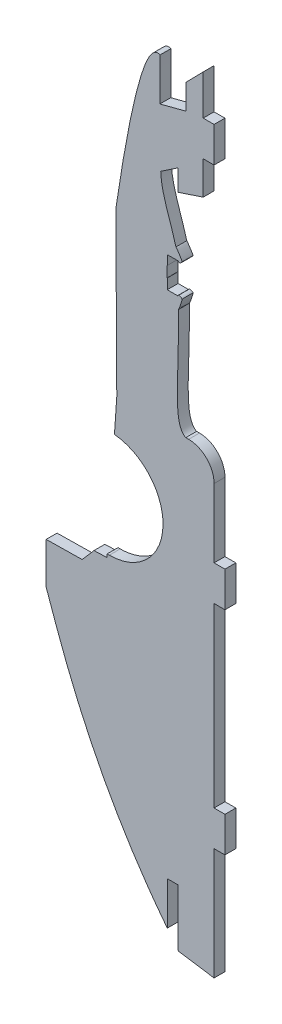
ISO-10303-21;
HEADER;
FILE_DESCRIPTION(('STEP AP214'),'2;1');
FILE_NAME('part.step','',(''),(''),'','','');
FILE_SCHEMA(('AUTOMOTIVE_DESIGN { 1 0 10303 214 1 1 1 1 }'));
ENDSEC;
DATA;
#1=APPLICATION_CONTEXT('core data for automotive mechanical design processes');
#2=APPLICATION_PROTOCOL_DEFINITION('international standard','automotive_design',2000,#1);
#3=PRODUCT_CONTEXT('',#1,'mechanical');
#4=PRODUCT('Part','Part','',(#3));
#5=PRODUCT_RELATED_PRODUCT_CATEGORY('part','',(#4));
#6=PRODUCT_DEFINITION_FORMATION('','',#4);
#7=PRODUCT_DEFINITION_CONTEXT('part definition',#1,'design');
#8=PRODUCT_DEFINITION('design','',#6,#7);
#9=PRODUCT_DEFINITION_SHAPE('','',#8);
#10=(LENGTH_UNIT() NAMED_UNIT(*) SI_UNIT(.MILLI.,.METRE.));
#11=(NAMED_UNIT(*) PLANE_ANGLE_UNIT() SI_UNIT($,.RADIAN.));
#12=(NAMED_UNIT(*) SI_UNIT($,.STERADIAN.) SOLID_ANGLE_UNIT());
#13=UNCERTAINTY_MEASURE_WITH_UNIT(LENGTH_MEASURE(1.E-05),#10,'distance_accuracy_value','');
#14=(GEOMETRIC_REPRESENTATION_CONTEXT(3) GLOBAL_UNCERTAINTY_ASSIGNED_CONTEXT((#13)) GLOBAL_UNIT_ASSIGNED_CONTEXT((#10,
#11,#12)) REPRESENTATION_CONTEXT('',''));
#15=CARTESIAN_POINT('',(0.,0.,0.));
#16=DIRECTION('',(0.,0.,1.));
#17=DIRECTION('',(1.,0.,0.));
#18=AXIS2_PLACEMENT_3D('',#15,#16,#17);
#19=CARTESIAN_POINT('',(692.191575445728,170.068470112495,3.));
#20=CARTESIAN_POINT('',(697.218400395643,160.665081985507,3.));
#21=CARTESIAN_POINT('',(702.990054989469,151.671832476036,3.));
#22=CARTESIAN_POINT('',(709.628064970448,143.178380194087,3.));
#23=B_SPLINE_CURVE_WITH_KNOTS('',3,(#19,#20,#21,#22),.UNSPECIFIED.,.F.,.F.,(4,4),(0.,1.),.UNSPECIFIED.);
#24=DIRECTION('',(0.,0.,-1.));
#25=VECTOR('',#24,1.);
#26=SURFACE_OF_LINEAR_EXTRUSION('',#23,#25);
#27=CARTESIAN_POINT('',(692.191575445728,170.068470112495,0.));
#28=CARTESIAN_POINT('',(697.218400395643,160.665081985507,0.));
#29=CARTESIAN_POINT('',(702.990054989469,151.671832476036,0.));
#30=CARTESIAN_POINT('',(709.628064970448,143.178380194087,0.));
#31=B_SPLINE_CURVE_WITH_KNOTS('',3,(#27,#28,#29,#30),.UNSPECIFIED.,.F.,.F.,(4,4),(0.,1.),.UNSPECIFIED.);
#32=CARTESIAN_POINT('',(692.191575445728,170.068470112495,0.));
#33=VERTEX_POINT('',#32);
#34=CARTESIAN_POINT('',(709.628064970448,143.178380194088,0.));
#35=VERTEX_POINT('',#34);
#36=EDGE_CURVE('E11',#33,#35,#31,.T.);
#37=ORIENTED_EDGE('',*,*,#36,.T.);
#38=DIRECTION('',(0.,0.,-1.));
#39=VECTOR('',#38,1.);
#40=CARTESIAN_POINT('',(709.628064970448,143.178380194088,3.));
#41=LINE('',#40,#39);
#42=CARTESIAN_POINT('',(709.628064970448,143.178380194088,3.));
#43=VERTEX_POINT('',#42);
#44=EDGE_CURVE('E1370',#43,#35,#41,.T.);
#45=ORIENTED_EDGE('',*,*,#44,.F.);
#46=CARTESIAN_POINT('',(692.191575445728,170.068470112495,3.));
#47=VERTEX_POINT('',#46);
#48=EDGE_CURVE('E47',#47,#43,#23,.T.);
#49=ORIENTED_EDGE('',*,*,#48,.F.);
#50=DIRECTION('',(0.,0.,-1.));
#51=VECTOR('',#50,1.);
#52=CARTESIAN_POINT('',(692.191575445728,170.068470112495,3.));
#53=LINE('',#52,#51);
#54=EDGE_CURVE('E478',#47,#33,#53,.T.);
#55=ORIENTED_EDGE('',*,*,#54,.T.);
#56=EDGE_LOOP('',(#37,#45,#49,#55));
#57=FACE_BOUND('',#56,.T.);
#58=ADVANCED_FACE('F44',(#57),#26,.F.);
#59=CARTESIAN_POINT('',(709.628064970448,143.178380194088,3.));
#60=DIRECTION('',(-1.,0.,0.));
#61=DIRECTION('',(0.,0.,1.));
#62=AXIS2_PLACEMENT_3D('',#59,#60,#61);
#63=PLANE('',#62);
#64=DIRECTION('',(0.,1.,0.));
#65=VECTOR('',#64,1.);
#66=CARTESIAN_POINT('',(709.628064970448,143.178380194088,0.));
#67=LINE('',#66,#65);
#68=CARTESIAN_POINT('',(709.628064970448,155.006943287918,0.));
#69=VERTEX_POINT('',#68);
#70=EDGE_CURVE('E56',#35,#69,#67,.T.);
#71=ORIENTED_EDGE('',*,*,#70,.T.);
#72=DIRECTION('',(0.,0.,-1.));
#73=VECTOR('',#72,1.);
#74=CARTESIAN_POINT('',(709.628064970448,155.006943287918,3.));
#75=LINE('',#74,#73);
#76=CARTESIAN_POINT('',(709.628064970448,155.006943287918,3.));
#77=VERTEX_POINT('',#76);
#78=EDGE_CURVE('E442',#77,#69,#75,.T.);
#79=ORIENTED_EDGE('',*,*,#78,.F.);
#80=DIRECTION('',(0.,1.,0.));
#81=VECTOR('',#80,1.);
#82=CARTESIAN_POINT('',(709.628064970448,143.178380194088,3.));
#83=LINE('',#82,#81);
#84=EDGE_CURVE('E253',#43,#77,#83,.T.);
#85=ORIENTED_EDGE('',*,*,#84,.F.);
#86=ORIENTED_EDGE('',*,*,#44,.T.);
#87=EDGE_LOOP('',(#71,#79,#85,#86));
#88=FACE_BOUND('',#87,.T.);
#89=ADVANCED_FACE('F504',(#88),#63,.F.);
#90=CARTESIAN_POINT('',(709.628064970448,155.006943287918,3.));
#91=DIRECTION('',(0.,1.,0.));
#92=DIRECTION('',(0.,0.,1.));
#93=AXIS2_PLACEMENT_3D('',#90,#91,#92);
#94=PLANE('',#93);
#95=DIRECTION('',(1.,0.,0.));
#96=VECTOR('',#95,1.);
#97=CARTESIAN_POINT('',(709.628064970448,155.006943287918,0.));
#98=LINE('',#97,#96);
#99=CARTESIAN_POINT('',(712.628054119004,155.006943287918,0.));
#100=VERTEX_POINT('',#99);
#101=EDGE_CURVE('E434',#69,#100,#98,.T.);
#102=ORIENTED_EDGE('',*,*,#101,.T.);
#103=DIRECTION('',(0.,0.,-1.));
#104=VECTOR('',#103,1.);
#105=CARTESIAN_POINT('',(712.628054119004,155.006943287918,3.));
#106=LINE('',#105,#104);
#107=CARTESIAN_POINT('',(712.628054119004,155.006943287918,3.));
#108=VERTEX_POINT('',#107);
#109=EDGE_CURVE('E438',#108,#100,#106,.T.);
#110=ORIENTED_EDGE('',*,*,#109,.F.);
#111=DIRECTION('',(1.,0.,0.));
#112=VECTOR('',#111,1.);
#113=CARTESIAN_POINT('',(709.628064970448,155.006943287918,3.));
#114=LINE('',#113,#112);
#115=EDGE_CURVE('E614',#77,#108,#114,.T.);
#116=ORIENTED_EDGE('',*,*,#115,.F.);
#117=ORIENTED_EDGE('',*,*,#78,.T.);
#118=EDGE_LOOP('',(#102,#110,#116,#117));
#119=FACE_BOUND('',#118,.T.);
#120=ADVANCED_FACE('F440',(#119),#94,.F.);
#121=CARTESIAN_POINT('',(712.628054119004,155.006943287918,3.));
#122=DIRECTION('',(1.,0.,0.));
#123=DIRECTION('',(0.,0.,-1.));
#124=AXIS2_PLACEMENT_3D('',#121,#122,#123);
#125=PLANE('',#124);
#126=DIRECTION('',(0.,-1.,0.));
#127=VECTOR('',#126,1.);
#128=CARTESIAN_POINT('',(712.628054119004,155.006943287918,0.));
#129=LINE('',#128,#127);
#130=CARTESIAN_POINT('',(712.628054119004,139.359233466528,0.));
#131=VERTEX_POINT('',#130);
#132=EDGE_CURVE('E441',#100,#131,#129,.T.);
#133=ORIENTED_EDGE('',*,*,#132,.T.);
#134=DIRECTION('',(0.,0.,-1.));
#135=VECTOR('',#134,1.);
#136=CARTESIAN_POINT('',(712.628054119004,139.359233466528,3.));
#137=LINE('',#136,#135);
#138=CARTESIAN_POINT('',(712.628054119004,139.359233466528,3.));
#139=VERTEX_POINT('',#138);
#140=EDGE_CURVE('E455',#139,#131,#137,.T.);
#141=ORIENTED_EDGE('',*,*,#140,.F.);
#142=DIRECTION('',(0.,-1.,0.));
#143=VECTOR('',#142,1.);
#144=CARTESIAN_POINT('',(712.628054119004,155.006943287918,3.));
#145=LINE('',#144,#143);
#146=EDGE_CURVE('E446',#108,#139,#145,.T.);
#147=ORIENTED_EDGE('',*,*,#146,.F.);
#148=ORIENTED_EDGE('',*,*,#109,.T.);
#149=EDGE_LOOP('',(#133,#141,#147,#148));
#150=FACE_BOUND('',#149,.T.);
#151=ADVANCED_FACE('F449',(#150),#125,.F.);
#152=CARTESIAN_POINT('',(712.628054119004,139.359233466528,3.));
#153=DIRECTION('',(0.785318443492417,0.619092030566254,0.));
#154=DIRECTION('',(-0.619092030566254,0.785318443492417,0.));
#155=AXIS2_PLACEMENT_3D('',#152,#153,#154);
#156=PLANE('',#155);
#157=DIRECTION('',(0.619092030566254,-0.785318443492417,0.));
#158=VECTOR('',#157,1.);
#159=CARTESIAN_POINT('',(712.628054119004,139.359233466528,0.));
#160=LINE('',#159,#158);
#161=CARTESIAN_POINT('',(712.759570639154,139.192404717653,0.));
#162=VERTEX_POINT('',#161);
#163=EDGE_CURVE('E460',#131,#162,#160,.T.);
#164=ORIENTED_EDGE('',*,*,#163,.T.);
#165=DIRECTION('',(0.,0.,-1.));
#166=VECTOR('',#165,1.);
#167=CARTESIAN_POINT('',(712.759570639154,139.192404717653,3.));
#168=LINE('',#167,#166);
#169=CARTESIAN_POINT('',(712.759570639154,139.192404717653,3.));
#170=VERTEX_POINT('',#169);
#171=EDGE_CURVE('E866',#170,#162,#168,.T.);
#172=ORIENTED_EDGE('',*,*,#171,.F.);
#173=DIRECTION('',(0.619092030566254,-0.785318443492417,0.));
#174=VECTOR('',#173,1.);
#175=CARTESIAN_POINT('',(712.628054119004,139.359233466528,3.));
#176=LINE('',#175,#174);
#177=EDGE_CURVE('E610',#139,#170,#176,.T.);
#178=ORIENTED_EDGE('',*,*,#177,.F.);
#179=ORIENTED_EDGE('',*,*,#140,.T.);
#180=EDGE_LOOP('',(#164,#172,#178,#179));
#181=FACE_BOUND('',#180,.T.);
#182=ADVANCED_FACE('F514',(#181),#156,.F.);
#183=CARTESIAN_POINT('',(712.759570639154,139.192404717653,3.));
#184=DIRECTION('',(0.14939170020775,0.988778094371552,0.));
#185=DIRECTION('',(-0.988778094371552,0.14939170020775,0.));
#186=AXIS2_PLACEMENT_3D('',#183,#184,#185);
#187=PLANE('',#186);
#188=DIRECTION('',(0.988778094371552,-0.14939170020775,0.));
#189=VECTOR('',#188,1.);
#190=CARTESIAN_POINT('',(712.759570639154,139.192404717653,0.));
#191=LINE('',#190,#189);
#192=CARTESIAN_POINT('',(722.535373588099,137.71540615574,0.));
#193=VERTEX_POINT('',#192);
#194=EDGE_CURVE('E463',#162,#193,#191,.T.);
#195=ORIENTED_EDGE('',*,*,#194,.T.);
#196=DIRECTION('',(0.,0.,-1.));
#197=VECTOR('',#196,1.);
#198=CARTESIAN_POINT('',(722.535373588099,137.71540615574,3.));
#199=LINE('',#198,#197);
#200=CARTESIAN_POINT('',(722.535373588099,137.71540615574,3.));
#201=VERTEX_POINT('',#200);
#202=EDGE_CURVE('E861',#201,#193,#199,.T.);
#203=ORIENTED_EDGE('',*,*,#202,.F.);
#204=DIRECTION('',(0.988778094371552,-0.14939170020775,0.));
#205=VECTOR('',#204,1.);
#206=CARTESIAN_POINT('',(712.759570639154,139.192404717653,3.));
#207=LINE('',#206,#205);
#208=EDGE_CURVE('E603',#170,#201,#207,.T.);
#209=ORIENTED_EDGE('',*,*,#208,.F.);
#210=ORIENTED_EDGE('',*,*,#171,.T.);
#211=EDGE_LOOP('',(#195,#203,#209,#210));
#212=FACE_BOUND('',#211,.T.);
#213=ADVANCED_FACE('F519',(#212),#187,.F.);
#214=CARTESIAN_POINT('',(722.535373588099,137.71540615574,3.));
#215=DIRECTION('',(-1.,0.,0.));
#216=DIRECTION('',(0.,0.,1.));
#217=AXIS2_PLACEMENT_3D('',#214,#215,#216);
#218=PLANE('',#217);
#219=DIRECTION('',(0.,1.,0.));
#220=VECTOR('',#219,1.);
#221=CARTESIAN_POINT('',(722.535373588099,137.71540615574,0.));
#222=LINE('',#221,#220);
#223=CARTESIAN_POINT('',(722.535373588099,168.642200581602,0.));
#224=VERTEX_POINT('',#223);
#225=EDGE_CURVE('E858',#193,#224,#222,.T.);
#226=ORIENTED_EDGE('',*,*,#225,.T.);
#227=DIRECTION('',(0.,0.,-1.));
#228=VECTOR('',#227,1.);
#229=CARTESIAN_POINT('',(722.535373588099,168.642200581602,3.));
#230=LINE('',#229,#228);
#231=CARTESIAN_POINT('',(722.535373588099,168.642200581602,3.));
#232=VERTEX_POINT('',#231);
#233=EDGE_CURVE('E871',#232,#224,#230,.T.);
#234=ORIENTED_EDGE('',*,*,#233,.F.);
#235=DIRECTION('',(0.,1.,0.));
#236=VECTOR('',#235,1.);
#237=CARTESIAN_POINT('',(722.535373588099,137.71540615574,3.));
#238=LINE('',#237,#236);
#239=EDGE_CURVE('E601',#201,#232,#238,.T.);
#240=ORIENTED_EDGE('',*,*,#239,.F.);
#241=ORIENTED_EDGE('',*,*,#202,.T.);
#242=EDGE_LOOP('',(#226,#234,#240,#241));
#243=FACE_BOUND('',#242,.T.);
#244=ADVANCED_FACE('F521',(#243),#218,.F.);
#245=CARTESIAN_POINT('',(722.535373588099,168.642200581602,3.));
#246=DIRECTION('',(0.,1.,0.));
#247=DIRECTION('',(0.,0.,1.));
#248=AXIS2_PLACEMENT_3D('',#245,#246,#247);
#249=PLANE('',#248);
#250=DIRECTION('',(1.,0.,0.));
#251=VECTOR('',#250,1.);
#252=CARTESIAN_POINT('',(722.535373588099,168.642200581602,0.));
#253=LINE('',#252,#251);
#254=CARTESIAN_POINT('',(725.543975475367,168.642200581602,0.));
#255=VERTEX_POINT('',#254);
#256=EDGE_CURVE('E852',#224,#255,#253,.T.);
#257=ORIENTED_EDGE('',*,*,#256,.T.);
#258=DIRECTION('',(0.,0.,-1.));
#259=VECTOR('',#258,1.);
#260=CARTESIAN_POINT('',(725.543975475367,168.642200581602,3.));
#261=LINE('',#260,#259);
#262=CARTESIAN_POINT('',(725.543975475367,168.642200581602,3.));
#263=VERTEX_POINT('',#262);
#264=EDGE_CURVE('E878',#263,#255,#261,.T.);
#265=ORIENTED_EDGE('',*,*,#264,.F.);
#266=DIRECTION('',(1.,0.,0.));
#267=VECTOR('',#266,1.);
#268=CARTESIAN_POINT('',(722.535373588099,168.642200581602,3.));
#269=LINE('',#268,#267);
#270=EDGE_CURVE('E598',#232,#263,#269,.T.);
#271=ORIENTED_EDGE('',*,*,#270,.F.);
#272=ORIENTED_EDGE('',*,*,#233,.T.);
#273=EDGE_LOOP('',(#257,#265,#271,#272));
#274=FACE_BOUND('',#273,.T.);
#275=ADVANCED_FACE('F524',(#274),#249,.F.);
#276=CARTESIAN_POINT('',(725.543975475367,168.642200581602,3.));
#277=DIRECTION('',(-1.,0.,0.));
#278=DIRECTION('',(0.,0.,1.));
#279=AXIS2_PLACEMENT_3D('',#276,#277,#278);
#280=PLANE('',#279);
#281=DIRECTION('',(0.,1.,0.));
#282=VECTOR('',#281,1.);
#283=CARTESIAN_POINT('',(725.543975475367,168.642200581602,0.));
#284=LINE('',#283,#282);
#285=CARTESIAN_POINT('',(725.543975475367,178.358834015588,0.));
#286=VERTEX_POINT('',#285);
#287=EDGE_CURVE('E846',#255,#286,#284,.T.);
#288=ORIENTED_EDGE('',*,*,#287,.T.);
#289=DIRECTION('',(0.,0.,-1.));
#290=VECTOR('',#289,1.);
#291=CARTESIAN_POINT('',(725.543975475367,178.358834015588,3.));
#292=LINE('',#291,#290);
#293=CARTESIAN_POINT('',(725.543975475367,178.358834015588,3.));
#294=VERTEX_POINT('',#293);
#295=EDGE_CURVE('E881',#294,#286,#292,.T.);
#296=ORIENTED_EDGE('',*,*,#295,.F.);
#297=DIRECTION('',(0.,1.,0.));
#298=VECTOR('',#297,1.);
#299=CARTESIAN_POINT('',(725.543975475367,168.642200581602,3.));
#300=LINE('',#299,#298);
#301=EDGE_CURVE('E594',#263,#294,#300,.T.);
#302=ORIENTED_EDGE('',*,*,#301,.F.);
#303=ORIENTED_EDGE('',*,*,#264,.T.);
#304=EDGE_LOOP('',(#288,#296,#302,#303));
#305=FACE_BOUND('',#304,.T.);
#306=ADVANCED_FACE('F530',(#305),#280,.F.);
#307=CARTESIAN_POINT('',(725.543975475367,178.358834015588,3.));
#308=DIRECTION('',(0.,-1.,0.));
#309=DIRECTION('',(0.,0.,-1.));
#310=AXIS2_PLACEMENT_3D('',#307,#308,#309);
#311=PLANE('',#310);
#312=DIRECTION('',(-1.,0.,0.));
#313=VECTOR('',#312,1.);
#314=CARTESIAN_POINT('',(725.543975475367,178.358834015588,0.));
#315=LINE('',#314,#313);
#316=CARTESIAN_POINT('',(722.535373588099,178.358834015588,0.));
#317=VERTEX_POINT('',#316);
#318=EDGE_CURVE('E848',#286,#317,#315,.T.);
#319=ORIENTED_EDGE('',*,*,#318,.T.);
#320=DIRECTION('',(0.,0.,-1.));
#321=VECTOR('',#320,1.);
#322=CARTESIAN_POINT('',(722.535373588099,178.358834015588,3.));
#323=LINE('',#322,#321);
#324=CARTESIAN_POINT('',(722.535373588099,178.358834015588,3.));
#325=VERTEX_POINT('',#324);
#326=EDGE_CURVE('E887',#325,#317,#323,.T.);
#327=ORIENTED_EDGE('',*,*,#326,.F.);
#328=DIRECTION('',(-1.,0.,0.));
#329=VECTOR('',#328,1.);
#330=CARTESIAN_POINT('',(725.543975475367,178.358834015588,3.));
#331=LINE('',#330,#329);
#332=EDGE_CURVE('E595',#294,#325,#331,.T.);
#333=ORIENTED_EDGE('',*,*,#332,.F.);
#334=ORIENTED_EDGE('',*,*,#295,.T.);
#335=EDGE_LOOP('',(#319,#327,#333,#334));
#336=FACE_BOUND('',#335,.T.);
#337=ADVANCED_FACE('F531',(#336),#311,.F.);
#338=CARTESIAN_POINT('',(722.535373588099,183.844373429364,3.));
#339=DIRECTION('',(-1.,0.,0.));
#340=DIRECTION('',(0.,0.,1.));
#341=AXIS2_PLACEMENT_3D('',#338,#339,#340);
#342=PLANE('',#341);
#343=DIRECTION('',(0.,1.,0.));
#344=VECTOR('',#343,1.);
#345=CARTESIAN_POINT('',(722.535373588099,183.844373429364,0.));
#346=LINE('',#345,#344);
#347=CARTESIAN_POINT('',(722.535373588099,227.2493037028,0.));
#348=VERTEX_POINT('',#347);
#349=EDGE_CURVE('E841',#317,#348,#346,.T.);
#350=ORIENTED_EDGE('',*,*,#349,.T.);
#351=DIRECTION('',(0.,0.,-1.));
#352=VECTOR('',#351,1.);
#353=CARTESIAN_POINT('',(722.535373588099,227.2493037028,3.));
#354=LINE('',#353,#352);
#355=CARTESIAN_POINT('',(722.535373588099,227.2493037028,3.));
#356=VERTEX_POINT('',#355);
#357=EDGE_CURVE('E894',#356,#348,#354,.T.);
#358=ORIENTED_EDGE('',*,*,#357,.F.);
#359=DIRECTION('',(0.,1.,0.));
#360=VECTOR('',#359,1.);
#361=CARTESIAN_POINT('',(722.535373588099,178.358834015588,3.));
#362=LINE('',#361,#360);
#363=EDGE_CURVE('E589',#325,#356,#362,.T.);
#364=ORIENTED_EDGE('',*,*,#363,.F.);
#365=ORIENTED_EDGE('',*,*,#326,.T.);
#366=EDGE_LOOP('',(#350,#358,#364,#365));
#367=FACE_BOUND('',#366,.T.);
#368=ADVANCED_FACE('F540',(#367),#342,.F.);
#369=CARTESIAN_POINT('',(722.535373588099,227.2493037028,3.));
#370=DIRECTION('',(0.,1.,0.));
#371=DIRECTION('',(0.,0.,1.));
#372=AXIS2_PLACEMENT_3D('',#369,#370,#371);
#373=PLANE('',#372);
#374=DIRECTION('',(1.,0.,0.));
#375=VECTOR('',#374,1.);
#376=CARTESIAN_POINT('',(722.535373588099,227.2493037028,0.));
#377=LINE('',#376,#375);
#378=CARTESIAN_POINT('',(725.543975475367,227.2493037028,0.));
#379=VERTEX_POINT('',#378);
#380=EDGE_CURVE('E839',#348,#379,#377,.T.);
#381=ORIENTED_EDGE('',*,*,#380,.T.);
#382=DIRECTION('',(0.,0.,-1.));
#383=VECTOR('',#382,1.);
#384=CARTESIAN_POINT('',(725.543975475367,227.2493037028,3.));
#385=LINE('',#384,#383);
#386=CARTESIAN_POINT('',(725.543975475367,227.2493037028,3.));
#387=VERTEX_POINT('',#386);
#388=EDGE_CURVE('E899',#387,#379,#385,.T.);
#389=ORIENTED_EDGE('',*,*,#388,.F.);
#390=DIRECTION('',(1.,0.,0.));
#391=VECTOR('',#390,1.);
#392=CARTESIAN_POINT('',(722.535373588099,227.2493037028,3.));
#393=LINE('',#392,#391);
#394=EDGE_CURVE('E588',#356,#387,#393,.T.);
#395=ORIENTED_EDGE('',*,*,#394,.F.);
#396=ORIENTED_EDGE('',*,*,#357,.T.);
#397=EDGE_LOOP('',(#381,#389,#395,#396));
#398=FACE_BOUND('',#397,.T.);
#399=ADVANCED_FACE('F541',(#398),#373,.F.);
#400=CARTESIAN_POINT('',(725.543975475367,227.2493037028,3.));
#401=DIRECTION('',(-1.,0.,0.));
#402=DIRECTION('',(0.,0.,1.));
#403=AXIS2_PLACEMENT_3D('',#400,#401,#402);
#404=PLANE('',#403);
#405=DIRECTION('',(0.,1.,0.));
#406=VECTOR('',#405,1.);
#407=CARTESIAN_POINT('',(725.543975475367,227.2493037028,0.));
#408=LINE('',#407,#406);
#409=CARTESIAN_POINT('',(725.543975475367,236.965937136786,0.));
#410=VERTEX_POINT('',#409);
#411=EDGE_CURVE('E840',#379,#410,#408,.T.);
#412=ORIENTED_EDGE('',*,*,#411,.T.);
#413=DIRECTION('',(0.,0.,-1.));
#414=VECTOR('',#413,1.);
#415=CARTESIAN_POINT('',(725.543975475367,236.965937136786,3.));
#416=LINE('',#415,#414);
#417=CARTESIAN_POINT('',(725.543975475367,236.965937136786,3.));
#418=VERTEX_POINT('',#417);
#419=EDGE_CURVE('E902',#418,#410,#416,.T.);
#420=ORIENTED_EDGE('',*,*,#419,.F.);
#421=DIRECTION('',(0.,1.,0.));
#422=VECTOR('',#421,1.);
#423=CARTESIAN_POINT('',(725.543975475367,227.2493037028,3.));
#424=LINE('',#423,#422);
#425=EDGE_CURVE('E581',#387,#418,#424,.T.);
#426=ORIENTED_EDGE('',*,*,#425,.F.);
#427=ORIENTED_EDGE('',*,*,#388,.T.);
#428=EDGE_LOOP('',(#412,#420,#426,#427));
#429=FACE_BOUND('',#428,.T.);
#430=ADVANCED_FACE('F544',(#429),#404,.F.);
#431=CARTESIAN_POINT('',(725.543975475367,236.965937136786,3.));
#432=DIRECTION('',(0.,-1.,0.));
#433=DIRECTION('',(0.,0.,-1.));
#434=AXIS2_PLACEMENT_3D('',#431,#432,#433);
#435=PLANE('',#434);
#436=DIRECTION('',(-1.,0.,0.));
#437=VECTOR('',#436,1.);
#438=CARTESIAN_POINT('',(725.543975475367,236.965937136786,0.));
#439=LINE('',#438,#437);
#440=CARTESIAN_POINT('',(722.535373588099,236.965937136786,0.));
#441=VERTEX_POINT('',#440);
#442=EDGE_CURVE('E835',#410,#441,#439,.T.);
#443=ORIENTED_EDGE('',*,*,#442,.T.);
#444=DIRECTION('',(0.,0.,-1.));
#445=VECTOR('',#444,1.);
#446=CARTESIAN_POINT('',(722.535373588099,236.965937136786,3.));
#447=LINE('',#446,#445);
#448=CARTESIAN_POINT('',(722.535373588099,236.965937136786,3.));
#449=VERTEX_POINT('',#448);
#450=EDGE_CURVE('E910',#449,#441,#447,.T.);
#451=ORIENTED_EDGE('',*,*,#450,.F.);
#452=DIRECTION('',(-1.,0.,0.));
#453=VECTOR('',#452,1.);
#454=CARTESIAN_POINT('',(725.543975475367,236.965937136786,3.));
#455=LINE('',#454,#453);
#456=EDGE_CURVE('E579',#418,#449,#455,.T.);
#457=ORIENTED_EDGE('',*,*,#456,.F.);
#458=ORIENTED_EDGE('',*,*,#419,.T.);
#459=EDGE_LOOP('',(#443,#451,#457,#458));
#460=FACE_BOUND('',#459,.T.);
#461=ADVANCED_FACE('F548',(#460),#435,.F.);
#462=CARTESIAN_POINT('',(722.535373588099,236.965937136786,3.));
#463=DIRECTION('',(-1.,0.,0.));
#464=DIRECTION('',(0.,0.,1.));
#465=AXIS2_PLACEMENT_3D('',#462,#463,#464);
#466=PLANE('',#465);
#467=DIRECTION('',(0.,1.,0.));
#468=VECTOR('',#467,1.);
#469=CARTESIAN_POINT('',(722.535373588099,236.965937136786,0.));
#470=LINE('',#469,#468);
#471=CARTESIAN_POINT('',(722.535373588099,255.926881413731,0.));
#472=VERTEX_POINT('',#471);
#473=EDGE_CURVE('E829',#441,#472,#470,.T.);
#474=ORIENTED_EDGE('',*,*,#473,.T.);
#475=DIRECTION('',(0.,0.,-1.));
#476=VECTOR('',#475,1.);
#477=CARTESIAN_POINT('',(722.535373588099,255.926881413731,3.));
#478=LINE('',#477,#476);
#479=CARTESIAN_POINT('',(722.535373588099,255.926881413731,3.));
#480=VERTEX_POINT('',#479);
#481=EDGE_CURVE('E913',#480,#472,#478,.T.);
#482=ORIENTED_EDGE('',*,*,#481,.F.);
#483=DIRECTION('',(0.,1.,0.));
#484=VECTOR('',#483,1.);
#485=CARTESIAN_POINT('',(722.535373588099,236.965937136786,3.));
#486=LINE('',#485,#484);
#487=EDGE_CURVE('E574',#449,#480,#486,.T.);
#488=ORIENTED_EDGE('',*,*,#487,.F.);
#489=ORIENTED_EDGE('',*,*,#450,.T.);
#490=EDGE_LOOP('',(#474,#482,#488,#489));
#491=FACE_BOUND('',#490,.T.);
#492=ADVANCED_FACE('F554',(#491),#466,.F.);
#493=CARTESIAN_POINT('',(722.535373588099,255.926881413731,3.));
#494=CARTESIAN_POINT('',(722.535373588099,259.813207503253,3.));
#495=CARTESIAN_POINT('',(719.39585807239,262.969517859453,3.));
#496=CARTESIAN_POINT('',(715.509531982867,262.990188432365,3.));
#497=B_SPLINE_CURVE_WITH_KNOTS('',3,(#493,#494,#495,#496),.UNSPECIFIED.,.F.,.F.,(4,4),(17.,18.),.UNSPECIFIED.);
#498=DIRECTION('',(0.,0.,-1.));
#499=VECTOR('',#498,1.);
#500=SURFACE_OF_LINEAR_EXTRUSION('',#497,#499);
#501=CARTESIAN_POINT('',(722.535373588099,255.926881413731,0.));
#502=CARTESIAN_POINT('',(722.535373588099,259.813207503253,0.));
#503=CARTESIAN_POINT('',(719.39585807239,262.969517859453,0.));
#504=CARTESIAN_POINT('',(715.509531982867,262.990188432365,0.));
#505=B_SPLINE_CURVE_WITH_KNOTS('',3,(#501,#502,#503,#504),.UNSPECIFIED.,.F.,.F.,(4,4),(17.,18.),.UNSPECIFIED.);
#506=CARTESIAN_POINT('',(715.509531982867,262.990188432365,0.));
#507=VERTEX_POINT('',#506);
#508=EDGE_CURVE('E822',#472,#507,#505,.T.);
#509=ORIENTED_EDGE('',*,*,#508,.T.);
#510=DIRECTION('',(0.,0.,-1.));
#511=VECTOR('',#510,1.);
#512=CARTESIAN_POINT('',(715.509531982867,262.990188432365,3.));
#513=LINE('',#512,#511);
#514=CARTESIAN_POINT('',(715.509531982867,262.990188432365,3.));
#515=VERTEX_POINT('',#514);
#516=EDGE_CURVE('E914',#515,#507,#513,.T.);
#517=ORIENTED_EDGE('',*,*,#516,.F.);
#518=EDGE_CURVE('E564',#480,#515,#497,.T.);
#519=ORIENTED_EDGE('',*,*,#518,.F.);
#520=ORIENTED_EDGE('',*,*,#481,.T.);
#521=EDGE_LOOP('',(#509,#517,#519,#520));
#522=FACE_BOUND('',#521,.T.);
#523=ADVANCED_FACE('F559',(#522),#500,.F.);
#524=CARTESIAN_POINT('',(715.509531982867,262.990188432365,3.));
#525=DIRECTION('',(-0.00533122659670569,-0.99998578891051,0.));
#526=DIRECTION('',(0.99998578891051,-0.00533122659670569,0.));
#527=AXIS2_PLACEMENT_3D('',#524,#525,#526);
#528=PLANE('',#527);
#529=DIRECTION('',(-0.99998578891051,0.00533122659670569,0.));
#530=VECTOR('',#529,1.);
#531=CARTESIAN_POINT('',(715.509531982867,262.990188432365,0.));
#532=LINE('',#531,#530);
#533=CARTESIAN_POINT('',(714.717935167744,262.994408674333,0.));
#534=VERTEX_POINT('',#533);
#535=EDGE_CURVE('E820',#507,#534,#532,.T.);
#536=ORIENTED_EDGE('',*,*,#535,.T.);
#537=DIRECTION('',(0.,0.,-1.));
#538=VECTOR('',#537,1.);
#539=CARTESIAN_POINT('',(714.717935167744,262.994408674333,3.));
#540=LINE('',#539,#538);
#541=CARTESIAN_POINT('',(714.717935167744,262.994408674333,3.));
#542=VERTEX_POINT('',#541);
#543=EDGE_CURVE('E919',#542,#534,#540,.T.);
#544=ORIENTED_EDGE('',*,*,#543,.F.);
#545=DIRECTION('',(-0.99998578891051,0.00533122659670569,0.));
#546=VECTOR('',#545,1.);
#547=CARTESIAN_POINT('',(715.509531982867,262.990188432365,3.));
#548=LINE('',#547,#546);
#549=EDGE_CURVE('E572',#515,#542,#548,.T.);
#550=ORIENTED_EDGE('',*,*,#549,.F.);
#551=ORIENTED_EDGE('',*,*,#516,.T.);
#552=EDGE_LOOP('',(#536,#544,#550,#551));
#553=FACE_BOUND('',#552,.T.);
#554=ADVANCED_FACE('F565',(#553),#528,.F.);
#555=CARTESIAN_POINT('',(714.717935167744,262.994408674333,3.));
#556=CARTESIAN_POINT('',(710.871227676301,264.790767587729,3.));
#557=CARTESIAN_POINT('',(713.002880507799,277.638992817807,3.));
#558=CARTESIAN_POINT('',(712.701693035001,292.610516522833,3.));
#559=B_SPLINE_CURVE_WITH_KNOTS('',3,(#555,#556,#557,#558),.UNSPECIFIED.,.F.,.F.,(4,4),(19.,20.),.UNSPECIFIED.);
#560=DIRECTION('',(0.,0.,-1.));
#561=VECTOR('',#560,1.);
#562=SURFACE_OF_LINEAR_EXTRUSION('',#559,#561);
#563=CARTESIAN_POINT('',(714.717935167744,262.994408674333,0.));
#564=CARTESIAN_POINT('',(710.871227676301,264.790767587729,0.));
#565=CARTESIAN_POINT('',(713.002880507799,277.638992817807,0.));
#566=CARTESIAN_POINT('',(712.701693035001,292.610516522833,0.));
#567=B_SPLINE_CURVE_WITH_KNOTS('',3,(#563,#564,#565,#566),.UNSPECIFIED.,.F.,.F.,(4,4),(19.,20.),.UNSPECIFIED.);
#568=CARTESIAN_POINT('',(712.701693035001,292.610516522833,0.));
#569=VERTEX_POINT('',#568);
#570=EDGE_CURVE('E809',#534,#569,#567,.T.);
#571=ORIENTED_EDGE('',*,*,#570,.T.);
#572=DIRECTION('',(0.,0.,-1.));
#573=VECTOR('',#572,1.);
#574=CARTESIAN_POINT('',(712.701693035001,292.610516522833,3.));
#575=LINE('',#574,#573);
#576=CARTESIAN_POINT('',(712.701693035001,292.610516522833,3.));
#577=VERTEX_POINT('',#576);
#578=EDGE_CURVE('E923',#577,#569,#575,.T.);
#579=ORIENTED_EDGE('',*,*,#578,.F.);
#580=EDGE_CURVE('E1334',#542,#577,#559,.T.);
#581=ORIENTED_EDGE('',*,*,#580,.F.);
#582=ORIENTED_EDGE('',*,*,#543,.T.);
#583=EDGE_LOOP('',(#571,#579,#581,#582));
#584=FACE_BOUND('',#583,.T.);
#585=ADVANCED_FACE('F1333',(#584),#562,.F.);
#586=CARTESIAN_POINT('',(712.701693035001,292.610516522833,3.));
#587=CARTESIAN_POINT('',(712.933289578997,292.828332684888,3.));
#588=CARTESIAN_POINT('',(713.787673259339,295.428690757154,3.));
#589=CARTESIAN_POINT('',(713.730829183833,295.617912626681,3.));
#590=B_SPLINE_CURVE_WITH_KNOTS('',3,(#586,#587,#588,#589),.UNSPECIFIED.,.F.,.F.,(4,4),(20.,21.),.UNSPECIFIED.);
#591=DIRECTION('',(0.,0.,-1.));
#592=VECTOR('',#591,1.);
#593=SURFACE_OF_LINEAR_EXTRUSION('',#590,#592);
#594=CARTESIAN_POINT('',(712.701693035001,292.610516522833,0.));
#595=CARTESIAN_POINT('',(712.933289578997,292.828332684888,0.));
#596=CARTESIAN_POINT('',(713.787673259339,295.428690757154,0.));
#597=CARTESIAN_POINT('',(713.730829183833,295.617912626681,0.));
#598=B_SPLINE_CURVE_WITH_KNOTS('',3,(#594,#595,#596,#597),.UNSPECIFIED.,.F.,.F.,(4,4),(20.,21.),.UNSPECIFIED.);
#599=CARTESIAN_POINT('',(713.730829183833,295.617912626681,0.));
#600=VERTEX_POINT('',#599);
#601=EDGE_CURVE('E803',#569,#600,#598,.T.);
#602=ORIENTED_EDGE('',*,*,#601,.T.);
#603=DIRECTION('',(0.,0.,-1.));
#604=VECTOR('',#603,1.);
#605=CARTESIAN_POINT('',(713.730829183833,295.617912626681,3.));
#606=LINE('',#605,#604);
#607=CARTESIAN_POINT('',(713.730829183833,295.617912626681,3.));
#608=VERTEX_POINT('',#607);
#609=EDGE_CURVE('E930',#608,#600,#606,.T.);
#610=ORIENTED_EDGE('',*,*,#609,.F.);
#611=EDGE_CURVE('E1326',#577,#608,#590,.T.);
#612=ORIENTED_EDGE('',*,*,#611,.F.);
#613=ORIENTED_EDGE('',*,*,#578,.T.);
#614=EDGE_LOOP('',(#602,#610,#612,#613));
#615=FACE_BOUND('',#614,.T.);
#616=ADVANCED_FACE('F1330',(#615),#593,.F.);
#617=CARTESIAN_POINT('',(713.730829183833,295.617912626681,3.));
#618=CARTESIAN_POINT('',(713.672090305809,295.813335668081,3.));
#619=CARTESIAN_POINT('',(712.970754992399,296.126494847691,3.));
#620=CARTESIAN_POINT('',(712.775331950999,296.067842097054,3.));
#621=B_SPLINE_CURVE_WITH_KNOTS('',3,(#617,#618,#619,#620),.UNSPECIFIED.,.F.,.F.,(4,4),(21.,22.),.UNSPECIFIED.);
#622=DIRECTION('',(0.,0.,-1.));
#623=VECTOR('',#622,1.);
#624=SURFACE_OF_LINEAR_EXTRUSION('',#621,#623);
#625=CARTESIAN_POINT('',(713.730829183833,295.617912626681,0.));
#626=CARTESIAN_POINT('',(713.672090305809,295.813335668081,0.));
#627=CARTESIAN_POINT('',(712.970754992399,296.126494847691,0.));
#628=CARTESIAN_POINT('',(712.775331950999,296.067842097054,0.));
#629=B_SPLINE_CURVE_WITH_KNOTS('',3,(#625,#626,#627,#628),.UNSPECIFIED.,.F.,.F.,(4,4),(21.,22.),.UNSPECIFIED.);
#630=CARTESIAN_POINT('',(712.775331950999,296.067842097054,0.));
#631=VERTEX_POINT('',#630);
#632=EDGE_CURVE('E792',#600,#631,#629,.T.);
#633=ORIENTED_EDGE('',*,*,#632,.T.);
#634=DIRECTION('',(0.,0.,-1.));
#635=VECTOR('',#634,1.);
#636=CARTESIAN_POINT('',(712.775331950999,296.067842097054,3.));
#637=LINE('',#636,#635);
#638=CARTESIAN_POINT('',(712.775331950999,296.067842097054,3.));
#639=VERTEX_POINT('',#638);
#640=EDGE_CURVE('E931',#639,#631,#637,.T.);
#641=ORIENTED_EDGE('',*,*,#640,.F.);
#642=EDGE_CURVE('E1328',#608,#639,#621,.T.);
#643=ORIENTED_EDGE('',*,*,#642,.F.);
#644=ORIENTED_EDGE('',*,*,#609,.T.);
#645=EDGE_LOOP('',(#633,#641,#643,#644));
#646=FACE_BOUND('',#645,.T.);
#647=ADVANCED_FACE('F1324',(#646),#624,.F.);
#648=CARTESIAN_POINT('',(712.775331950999,296.067842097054,3.));
#649=CARTESIAN_POINT('',(712.642092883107,296.027706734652,3.));
#650=CARTESIAN_POINT('',(712.553381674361,295.917463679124,3.));
#651=CARTESIAN_POINT('',(712.525734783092,295.790511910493,3.));
#652=B_SPLINE_CURVE_WITH_KNOTS('',3,(#648,#649,#650,#651),.UNSPECIFIED.,.F.,.F.,(4,4),(22.,23.),.UNSPECIFIED.);
#653=DIRECTION('',(0.,0.,-1.));
#654=VECTOR('',#653,1.);
#655=SURFACE_OF_LINEAR_EXTRUSION('',#652,#654);
#656=CARTESIAN_POINT('',(712.775331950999,296.067842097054,0.));
#657=CARTESIAN_POINT('',(712.642092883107,296.027706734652,0.));
#658=CARTESIAN_POINT('',(712.553381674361,295.917463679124,0.));
#659=CARTESIAN_POINT('',(712.525734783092,295.790511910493,0.));
#660=B_SPLINE_CURVE_WITH_KNOTS('',3,(#656,#657,#658,#659),.UNSPECIFIED.,.F.,.F.,(4,4),(22.,23.),.UNSPECIFIED.);
#661=CARTESIAN_POINT('',(712.525734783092,295.790511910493,0.));
#662=VERTEX_POINT('',#661);
#663=EDGE_CURVE('E786',#631,#662,#660,.T.);
#664=ORIENTED_EDGE('',*,*,#663,.T.);
#665=DIRECTION('',(0.,0.,-1.));
#666=VECTOR('',#665,1.);
#667=CARTESIAN_POINT('',(712.525734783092,295.790511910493,3.));
#668=LINE('',#667,#666);
#669=CARTESIAN_POINT('',(712.525734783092,295.790511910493,3.));
#670=VERTEX_POINT('',#669);
#671=EDGE_CURVE('E934',#670,#662,#668,.T.);
#672=ORIENTED_EDGE('',*,*,#671,.F.);
#673=EDGE_CURVE('E1320',#639,#670,#652,.T.);
#674=ORIENTED_EDGE('',*,*,#673,.F.);
#675=ORIENTED_EDGE('',*,*,#640,.T.);
#676=EDGE_LOOP('',(#664,#672,#674,#675));
#677=FACE_BOUND('',#676,.T.);
#678=ADVANCED_FACE('F1316',(#677),#655,.F.);
#679=CARTESIAN_POINT('',(712.525734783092,295.790511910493,3.));
#680=DIRECTION('',(0.,-1.,0.));
#681=DIRECTION('',(0.,0.,-1.));
#682=AXIS2_PLACEMENT_3D('',#679,#680,#681);
#683=PLANE('',#682);
#684=DIRECTION('',(-1.,0.,0.));
#685=VECTOR('',#684,1.);
#686=CARTESIAN_POINT('',(712.525734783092,295.790511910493,0.));
#687=LINE('',#686,#685);
#688=CARTESIAN_POINT('',(709.611614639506,295.790511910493,0.));
#689=VERTEX_POINT('',#688);
#690=EDGE_CURVE('E784',#662,#689,#687,.T.);
#691=ORIENTED_EDGE('',*,*,#690,.T.);
#692=DIRECTION('',(0.,0.,-1.));
#693=VECTOR('',#692,1.);
#694=CARTESIAN_POINT('',(709.611614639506,295.790511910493,3.));
#695=LINE('',#694,#693);
#696=CARTESIAN_POINT('',(709.611614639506,295.790511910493,3.));
#697=VERTEX_POINT('',#696);
#698=EDGE_CURVE('E936',#697,#689,#695,.T.);
#699=ORIENTED_EDGE('',*,*,#698,.F.);
#700=DIRECTION('',(-1.,0.,0.));
#701=VECTOR('',#700,1.);
#702=CARTESIAN_POINT('',(712.525734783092,295.790511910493,3.));
#703=LINE('',#702,#701);
#704=EDGE_CURVE('E1315',#670,#697,#703,.T.);
#705=ORIENTED_EDGE('',*,*,#704,.F.);
#706=ORIENTED_EDGE('',*,*,#671,.T.);
#707=EDGE_LOOP('',(#691,#699,#705,#706));
#708=FACE_BOUND('',#707,.T.);
#709=ADVANCED_FACE('F1311',(#708),#683,.F.);
#710=CARTESIAN_POINT('',(709.611614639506,295.790511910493,3.));
#711=DIRECTION('',(-1.,0.,0.));
#712=DIRECTION('',(0.,0.,1.));
#713=AXIS2_PLACEMENT_3D('',#710,#711,#712);
#714=PLANE('',#713);
#715=DIRECTION('',(0.,1.,0.));
#716=VECTOR('',#715,1.);
#717=CARTESIAN_POINT('',(709.611614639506,295.790511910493,0.));
#718=LINE('',#717,#716);
#719=CARTESIAN_POINT('',(709.611614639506,298.600762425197,0.));
#720=VERTEX_POINT('',#719);
#721=EDGE_CURVE('E785',#689,#720,#718,.T.);
#722=ORIENTED_EDGE('',*,*,#721,.T.);
#723=DIRECTION('',(0.,0.,-1.));
#724=VECTOR('',#723,1.);
#725=CARTESIAN_POINT('',(709.611614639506,298.600762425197,3.));
#726=LINE('',#725,#724);
#727=CARTESIAN_POINT('',(709.611614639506,298.600762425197,3.));
#728=VERTEX_POINT('',#727);
#729=EDGE_CURVE('E942',#728,#720,#726,.T.);
#730=ORIENTED_EDGE('',*,*,#729,.F.);
#731=DIRECTION('',(0.,1.,0.));
#732=VECTOR('',#731,1.);
#733=CARTESIAN_POINT('',(709.611614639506,295.790511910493,3.));
#734=LINE('',#733,#732);
#735=EDGE_CURVE('E1308',#697,#728,#734,.T.);
#736=ORIENTED_EDGE('',*,*,#735,.F.);
#737=ORIENTED_EDGE('',*,*,#698,.T.);
#738=EDGE_LOOP('',(#722,#730,#736,#737));
#739=FACE_BOUND('',#738,.T.);
#740=ADVANCED_FACE('F1302',(#739),#714,.F.);
#741=CARTESIAN_POINT('',(709.611614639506,298.600762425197,3.));
#742=DIRECTION('',(0.,-1.,0.));
#743=DIRECTION('',(0.,0.,-1.));
#744=AXIS2_PLACEMENT_3D('',#741,#742,#743);
#745=PLANE('',#744);
#746=DIRECTION('',(-1.,0.,0.));
#747=VECTOR('',#746,1.);
#748=CARTESIAN_POINT('',(709.611614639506,298.600762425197,0.));
#749=LINE('',#748,#747);
#750=CARTESIAN_POINT('',(709.557268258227,298.600762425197,0.));
#751=VERTEX_POINT('',#750);
#752=EDGE_CURVE('E777',#720,#751,#749,.T.);
#753=ORIENTED_EDGE('',*,*,#752,.T.);
#754=DIRECTION('',(0.,0.,-1.));
#755=VECTOR('',#754,1.);
#756=CARTESIAN_POINT('',(709.557268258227,298.600762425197,3.));
#757=LINE('',#756,#755);
#758=CARTESIAN_POINT('',(709.557268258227,298.600762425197,3.));
#759=VERTEX_POINT('',#758);
#760=EDGE_CURVE('E950',#759,#751,#757,.T.);
#761=ORIENTED_EDGE('',*,*,#760,.F.);
#762=DIRECTION('',(-1.,0.,0.));
#763=VECTOR('',#762,1.);
#764=CARTESIAN_POINT('',(709.611614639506,298.600762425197,3.));
#765=LINE('',#764,#763);
#766=EDGE_CURVE('E1300',#728,#759,#765,.T.);
#767=ORIENTED_EDGE('',*,*,#766,.F.);
#768=ORIENTED_EDGE('',*,*,#729,.T.);
#769=EDGE_LOOP('',(#753,#761,#767,#768));
#770=FACE_BOUND('',#769,.T.);
#771=ADVANCED_FACE('F1296',(#770),#745,.F.);
#772=CARTESIAN_POINT('',(709.557268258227,300.680480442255,3.));
#773=DIRECTION('',(-1.,0.,0.));
#774=DIRECTION('',(0.,0.,1.));
#775=AXIS2_PLACEMENT_3D('',#772,#773,#774);
#776=PLANE('',#775);
#777=DIRECTION('',(0.,1.,0.));
#778=VECTOR('',#777,1.);
#779=CARTESIAN_POINT('',(709.557268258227,300.680480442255,0.));
#780=LINE('',#779,#778);
#781=CARTESIAN_POINT('',(709.557268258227,301.600751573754,0.));
#782=VERTEX_POINT('',#781);
#783=EDGE_CURVE('E773',#751,#782,#780,.T.);
#784=ORIENTED_EDGE('',*,*,#783,.T.);
#785=DIRECTION('',(0.,0.,-1.));
#786=VECTOR('',#785,1.);
#787=CARTESIAN_POINT('',(709.557268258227,301.600751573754,3.));
#788=LINE('',#787,#786);
#789=CARTESIAN_POINT('',(709.557268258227,301.600751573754,3.));
#790=VERTEX_POINT('',#789);
#791=EDGE_CURVE('E952',#790,#782,#788,.T.);
#792=ORIENTED_EDGE('',*,*,#791,.F.);
#793=DIRECTION('',(0.,1.,0.));
#794=VECTOR('',#793,1.);
#795=CARTESIAN_POINT('',(709.557268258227,298.600762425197,3.));
#796=LINE('',#795,#794);
#797=EDGE_CURVE('E1293',#759,#790,#796,.T.);
#798=ORIENTED_EDGE('',*,*,#797,.F.);
#799=ORIENTED_EDGE('',*,*,#760,.T.);
#800=EDGE_LOOP('',(#784,#792,#798,#799));
#801=FACE_BOUND('',#800,.T.);
#802=ADVANCED_FACE('F1292',(#801),#776,.F.);
#803=CARTESIAN_POINT('',(709.557268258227,301.600751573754,3.));
#804=DIRECTION('',(0.,1.,0.));
#805=DIRECTION('',(0.,0.,1.));
#806=AXIS2_PLACEMENT_3D('',#803,#804,#805);
#807=PLANE('',#806);
#808=DIRECTION('',(1.,0.,0.));
#809=VECTOR('',#808,1.);
#810=CARTESIAN_POINT('',(709.557268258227,301.600751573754,0.));
#811=LINE('',#810,#809);
#812=CARTESIAN_POINT('',(709.611614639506,301.600751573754,0.));
#813=VERTEX_POINT('',#812);
#814=EDGE_CURVE('E775',#782,#813,#811,.T.);
#815=ORIENTED_EDGE('',*,*,#814,.T.);
#816=DIRECTION('',(0.,0.,-1.));
#817=VECTOR('',#816,1.);
#818=CARTESIAN_POINT('',(709.611614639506,301.600751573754,3.));
#819=LINE('',#818,#817);
#820=CARTESIAN_POINT('',(709.611614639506,301.600751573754,3.));
#821=VERTEX_POINT('',#820);
#822=EDGE_CURVE('E953',#821,#813,#819,.T.);
#823=ORIENTED_EDGE('',*,*,#822,.F.);
#824=DIRECTION('',(1.,0.,0.));
#825=VECTOR('',#824,1.);
#826=CARTESIAN_POINT('',(709.557268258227,301.600751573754,3.));
#827=LINE('',#826,#825);
#828=EDGE_CURVE('E1286',#790,#821,#827,.T.);
#829=ORIENTED_EDGE('',*,*,#828,.F.);
#830=ORIENTED_EDGE('',*,*,#791,.T.);
#831=EDGE_LOOP('',(#815,#823,#829,#830));
#832=FACE_BOUND('',#831,.T.);
#833=ADVANCED_FACE('F1289',(#832),#807,.F.);
#834=CARTESIAN_POINT('',(709.611614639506,301.600751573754,3.));
#835=DIRECTION('',(-1.,0.,0.));
#836=DIRECTION('',(0.,0.,1.));
#837=AXIS2_PLACEMENT_3D('',#834,#835,#836);
#838=PLANE('',#837);
#839=DIRECTION('',(0.,1.,0.));
#840=VECTOR('',#839,1.);
#841=CARTESIAN_POINT('',(709.611614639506,301.600751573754,0.));
#842=LINE('',#841,#840);
#843=CARTESIAN_POINT('',(709.611614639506,304.190774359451,0.));
#844=VERTEX_POINT('',#843);
#845=EDGE_CURVE('E768',#813,#844,#842,.T.);
#846=ORIENTED_EDGE('',*,*,#845,.T.);
#847=DIRECTION('',(0.,0.,-1.));
#848=VECTOR('',#847,1.);
#849=CARTESIAN_POINT('',(709.611614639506,304.190774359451,3.));
#850=LINE('',#849,#848);
#851=CARTESIAN_POINT('',(709.611614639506,304.190774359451,3.));
#852=VERTEX_POINT('',#851);
#853=EDGE_CURVE('E960',#852,#844,#850,.T.);
#854=ORIENTED_EDGE('',*,*,#853,.F.);
#855=DIRECTION('',(0.,1.,0.));
#856=VECTOR('',#855,1.);
#857=CARTESIAN_POINT('',(709.611614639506,301.600751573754,3.));
#858=LINE('',#857,#856);
#859=EDGE_CURVE('E1285',#821,#852,#858,.T.);
#860=ORIENTED_EDGE('',*,*,#859,.F.);
#861=ORIENTED_EDGE('',*,*,#822,.T.);
#862=EDGE_LOOP('',(#846,#854,#860,#861));
#863=FACE_BOUND('',#862,.T.);
#864=ADVANCED_FACE('F1282',(#863),#838,.F.);
#865=CARTESIAN_POINT('',(709.611614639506,304.190774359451,3.));
#866=DIRECTION('',(0.,1.,0.));
#867=DIRECTION('',(0.,0.,1.));
#868=AXIS2_PLACEMENT_3D('',#865,#866,#867);
#869=PLANE('',#868);
#870=DIRECTION('',(1.,0.,0.));
#871=VECTOR('',#870,1.);
#872=CARTESIAN_POINT('',(709.611614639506,304.190774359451,0.));
#873=LINE('',#872,#871);
#874=CARTESIAN_POINT('',(712.627020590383,304.190774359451,0.));
#875=VERTEX_POINT('',#874);
#876=EDGE_CURVE('E763',#844,#875,#873,.T.);
#877=ORIENTED_EDGE('',*,*,#876,.T.);
#878=DIRECTION('',(0.,0.,-1.));
#879=VECTOR('',#878,1.);
#880=CARTESIAN_POINT('',(712.627020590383,304.190774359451,3.));
#881=LINE('',#880,#879);
#882=CARTESIAN_POINT('',(712.627020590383,304.190774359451,3.));
#883=VERTEX_POINT('',#882);
#884=EDGE_CURVE('E962',#883,#875,#881,.T.);
#885=ORIENTED_EDGE('',*,*,#884,.F.);
#886=DIRECTION('',(1.,0.,0.));
#887=VECTOR('',#886,1.);
#888=CARTESIAN_POINT('',(709.611614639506,304.190774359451,3.));
#889=LINE('',#888,#887);
#890=EDGE_CURVE('E1280',#852,#883,#889,.T.);
#891=ORIENTED_EDGE('',*,*,#890,.F.);
#892=ORIENTED_EDGE('',*,*,#853,.T.);
#893=EDGE_LOOP('',(#877,#885,#891,#892));
#894=FACE_BOUND('',#893,.T.);
#895=ADVANCED_FACE('F1276',(#894),#869,.F.);
#896=CARTESIAN_POINT('',(712.627020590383,304.190774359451,3.));
#897=CARTESIAN_POINT('',(712.673615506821,304.040137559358,3.));
#898=CARTESIAN_POINT('',(712.80874937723,303.92868872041,3.));
#899=CARTESIAN_POINT('',(712.974716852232,303.92868872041,3.));
#900=B_SPLINE_CURVE_WITH_KNOTS('',3,(#896,#897,#898,#899),.UNSPECIFIED.,.F.,.F.,(4,4),(32.,33.),.UNSPECIFIED.);
#901=DIRECTION('',(0.,0.,-1.));
#902=VECTOR('',#901,1.);
#903=SURFACE_OF_LINEAR_EXTRUSION('',#900,#902);
#904=CARTESIAN_POINT('',(712.627020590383,304.190774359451,0.));
#905=CARTESIAN_POINT('',(712.673615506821,304.040137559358,0.));
#906=CARTESIAN_POINT('',(712.80874937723,303.92868872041,0.));
#907=CARTESIAN_POINT('',(712.974716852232,303.92868872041,0.));
#908=B_SPLINE_CURVE_WITH_KNOTS('',3,(#904,#905,#906,#907),.UNSPECIFIED.,.F.,.F.,(4,4),(32.,33.),.UNSPECIFIED.);
#909=CARTESIAN_POINT('',(712.974716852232,303.92868872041,0.));
#910=VERTEX_POINT('',#909);
#911=EDGE_CURVE('E752',#875,#910,#908,.T.);
#912=ORIENTED_EDGE('',*,*,#911,.T.);
#913=DIRECTION('',(0.,0.,-1.));
#914=VECTOR('',#913,1.);
#915=CARTESIAN_POINT('',(712.974716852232,303.92868872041,3.));
#916=LINE('',#915,#914);
#917=CARTESIAN_POINT('',(712.974716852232,303.92868872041,3.));
#918=VERTEX_POINT('',#917);
#919=EDGE_CURVE('E967',#918,#910,#916,.T.);
#920=ORIENTED_EDGE('',*,*,#919,.F.);
#921=EDGE_CURVE('E1272',#883,#918,#900,.T.);
#922=ORIENTED_EDGE('',*,*,#921,.F.);
#923=ORIENTED_EDGE('',*,*,#884,.T.);
#924=EDGE_LOOP('',(#912,#920,#922,#923));
#925=FACE_BOUND('',#924,.T.);
#926=ADVANCED_FACE('F1268',(#925),#903,.F.);
#927=CARTESIAN_POINT('',(712.974716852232,303.92868872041,3.));
#928=CARTESIAN_POINT('',(713.178752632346,303.92868872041,3.));
#929=CARTESIAN_POINT('',(713.730829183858,304.319793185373,3.));
#930=CARTESIAN_POINT('',(713.730829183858,304.523828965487,3.));
#931=B_SPLINE_CURVE_WITH_KNOTS('',3,(#927,#928,#929,#930),.UNSPECIFIED.,.F.,.F.,(4,4),(33.,34.),.UNSPECIFIED.);
#932=DIRECTION('',(0.,0.,-1.));
#933=VECTOR('',#932,1.);
#934=SURFACE_OF_LINEAR_EXTRUSION('',#931,#933);
#935=CARTESIAN_POINT('',(712.974716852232,303.92868872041,0.));
#936=CARTESIAN_POINT('',(713.178752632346,303.92868872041,0.));
#937=CARTESIAN_POINT('',(713.730829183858,304.319793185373,0.));
#938=CARTESIAN_POINT('',(713.730829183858,304.523828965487,0.));
#939=B_SPLINE_CURVE_WITH_KNOTS('',3,(#935,#936,#937,#938),.UNSPECIFIED.,.F.,.F.,(4,4),(33.,34.),.UNSPECIFIED.);
#940=CARTESIAN_POINT('',(713.730829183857,304.523828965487,0.));
#941=VERTEX_POINT('',#940);
#942=EDGE_CURVE('E747',#910,#941,#939,.T.);
#943=ORIENTED_EDGE('',*,*,#942,.T.);
#944=DIRECTION('',(0.,0.,-1.));
#945=VECTOR('',#944,1.);
#946=CARTESIAN_POINT('',(713.730829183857,304.523828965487,3.));
#947=LINE('',#946,#945);
#948=CARTESIAN_POINT('',(713.730829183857,304.523828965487,3.));
#949=VERTEX_POINT('',#948);
#950=EDGE_CURVE('E973',#949,#941,#947,.T.);
#951=ORIENTED_EDGE('',*,*,#950,.F.);
#952=EDGE_CURVE('E1263',#918,#949,#931,.T.);
#953=ORIENTED_EDGE('',*,*,#952,.F.);
#954=ORIENTED_EDGE('',*,*,#919,.T.);
#955=EDGE_LOOP('',(#943,#951,#953,#954));
#956=FACE_BOUND('',#955,.T.);
#957=ADVANCED_FACE('F1262',(#956),#934,.F.);
#958=CARTESIAN_POINT('',(713.730829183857,304.523828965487,3.));
#959=CARTESIAN_POINT('',(713.73082918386,304.720630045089,3.));
#960=CARTESIAN_POINT('',(712.289056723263,307.045294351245,3.));
#961=CARTESIAN_POINT('',(712.004061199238,307.209194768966,3.));
#962=B_SPLINE_CURVE_WITH_KNOTS('',3,(#958,#959,#960,#961),.UNSPECIFIED.,.F.,.F.,(4,4),(34.,35.),.UNSPECIFIED.);
#963=DIRECTION('',(0.,0.,-1.));
#964=VECTOR('',#963,1.);
#965=SURFACE_OF_LINEAR_EXTRUSION('',#962,#964);
#966=CARTESIAN_POINT('',(713.730829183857,304.523828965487,0.));
#967=CARTESIAN_POINT('',(713.73082918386,304.720630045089,0.));
#968=CARTESIAN_POINT('',(712.289056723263,307.045294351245,0.));
#969=CARTESIAN_POINT('',(712.004061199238,307.209194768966,0.));
#970=B_SPLINE_CURVE_WITH_KNOTS('',3,(#966,#967,#968,#969),.UNSPECIFIED.,.F.,.F.,(4,4),(34.,35.),.UNSPECIFIED.);
#971=CARTESIAN_POINT('',(712.004061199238,307.209194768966,0.));
#972=VERTEX_POINT('',#971);
#973=EDGE_CURVE('E740',#941,#972,#970,.T.);
#974=ORIENTED_EDGE('',*,*,#973,.T.);
#975=DIRECTION('',(0.,0.,-1.));
#976=VECTOR('',#975,1.);
#977=CARTESIAN_POINT('',(712.004061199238,307.209194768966,3.));
#978=LINE('',#977,#976);
#979=CARTESIAN_POINT('',(712.004061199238,307.209194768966,3.));
#980=VERTEX_POINT('',#979);
#981=EDGE_CURVE('E972',#980,#972,#978,.T.);
#982=ORIENTED_EDGE('',*,*,#981,.F.);
#983=EDGE_CURVE('E1257',#949,#980,#962,.T.);
#984=ORIENTED_EDGE('',*,*,#983,.F.);
#985=ORIENTED_EDGE('',*,*,#950,.T.);
#986=EDGE_LOOP('',(#974,#982,#984,#985));
#987=FACE_BOUND('',#986,.T.);
#988=ADVANCED_FACE('F1258',(#987),#965,.F.);
#989=CARTESIAN_POINT('',(712.004061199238,307.209194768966,3.));
#990=CARTESIAN_POINT('',(710.571762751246,312.652704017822,3.));
#991=CARTESIAN_POINT('',(707.931183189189,318.095179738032,3.));
#992=CARTESIAN_POINT('',(707.806126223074,323.200552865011,3.));
#993=B_SPLINE_CURVE_WITH_KNOTS('',3,(#989,#990,#991,#992),.UNSPECIFIED.,.F.,.F.,(4,4),(35.,36.),.UNSPECIFIED.);
#994=DIRECTION('',(0.,0.,-1.));
#995=VECTOR('',#994,1.);
#996=SURFACE_OF_LINEAR_EXTRUSION('',#993,#995);
#997=CARTESIAN_POINT('',(712.004061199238,307.209194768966,0.));
#998=CARTESIAN_POINT('',(710.571762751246,312.652704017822,0.));
#999=CARTESIAN_POINT('',(707.931183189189,318.095179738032,0.));
#1000=CARTESIAN_POINT('',(707.806126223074,323.200552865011,0.));
#1001=B_SPLINE_CURVE_WITH_KNOTS('',3,(#997,#998,#999,#1000),.UNSPECIFIED.,.F.,.F.,(4,4),(35.,
36.),.UNSPECIFIED.);
#1002=CARTESIAN_POINT('',(707.806126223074,323.200552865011,0.));
#1003=VERTEX_POINT('',#1002);
#1004=EDGE_CURVE('E734',#972,#1003,#1001,.T.);
#1005=ORIENTED_EDGE('',*,*,#1004,.T.);
#1006=DIRECTION('',(0.,0.,-1.));
#1007=VECTOR('',#1006,1.);
#1008=CARTESIAN_POINT('',(707.806126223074,323.200552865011,3.));
#1009=LINE('',#1008,#1007);
#1010=CARTESIAN_POINT('',(707.806126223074,323.200552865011,3.));
#1011=VERTEX_POINT('',#1010);
#1012=EDGE_CURVE('E977',#1011,#1003,#1009,.T.);
#1013=ORIENTED_EDGE('',*,*,#1012,.F.);
#1014=EDGE_CURVE('E1254',#980,#1011,#993,.T.);
#1015=ORIENTED_EDGE('',*,*,#1014,.F.);
#1016=ORIENTED_EDGE('',*,*,#981,.T.);
#1017=EDGE_LOOP('',(#1005,#1013,#1015,#1016));
#1018=FACE_BOUND('',#1017,.T.);
#1019=ADVANCED_FACE('F1255',(#1018),#996,.F.);
#1020=CARTESIAN_POINT('',(707.806126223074,323.200552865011,3.));
#1021=DIRECTION('',(-0.559383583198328,0.82890892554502,0.));
#1022=DIRECTION('',(-0.82890892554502,-0.559383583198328,0.));
#1023=AXIS2_PLACEMENT_3D('',#1020,#1021,#1022);
#1024=PLANE('',#1023);
#1025=DIRECTION('',(0.82890892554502,0.559383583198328,0.));
#1026=VECTOR('',#1025,1.);
#1027=CARTESIAN_POINT('',(707.806126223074,323.200552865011,0.));
#1028=LINE('',#1027,#1026);
#1029=CARTESIAN_POINT('',(712.640973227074,326.463316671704,0.));
#1030=VERTEX_POINT('',#1029);
#1031=EDGE_CURVE('E732',#1003,#1030,#1028,.T.);
#1032=ORIENTED_EDGE('',*,*,#1031,.T.);
#1033=DIRECTION('',(0.,0.,-1.));
#1034=VECTOR('',#1033,1.);
#1035=CARTESIAN_POINT('',(712.640973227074,326.463316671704,3.));
#1036=LINE('',#1035,#1034);
#1037=CARTESIAN_POINT('',(712.640973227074,326.463316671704,3.));
#1038=VERTEX_POINT('',#1037);
#1039=EDGE_CURVE('E983',#1038,#1030,#1036,.T.);
#1040=ORIENTED_EDGE('',*,*,#1039,.F.);
#1041=DIRECTION('',(0.82890892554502,0.559383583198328,0.));
#1042=VECTOR('',#1041,1.);
#1043=CARTESIAN_POINT('',(707.806126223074,323.200552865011,3.));
#1044=LINE('',#1043,#1042);
#1045=EDGE_CURVE('E1248',#1011,#1038,#1044,.T.);
#1046=ORIENTED_EDGE('',*,*,#1045,.F.);
#1047=ORIENTED_EDGE('',*,*,#1012,.T.);
#1048=EDGE_LOOP('',(#1032,#1040,#1046,#1047));
#1049=FACE_BOUND('',#1048,.T.);
#1050=ADVANCED_FACE('F1244',(#1049),#1024,.F.);
#1051=CARTESIAN_POINT('',(712.640973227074,326.463316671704,3.));
#1052=DIRECTION('',(1.,0.,0.));
#1053=DIRECTION('',(0.,0.,-1.));
#1054=AXIS2_PLACEMENT_3D('',#1051,#1052,#1053);
#1055=PLANE('',#1054);
#1056=DIRECTION('',(0.,-1.,0.));
#1057=VECTOR('',#1056,1.);
#1058=CARTESIAN_POINT('',(712.640973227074,326.463316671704,0.));
#1059=LINE('',#1058,#1057);
#1060=CARTESIAN_POINT('',(712.640973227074,320.607429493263,0.));
#1061=VERTEX_POINT('',#1060);
#1062=EDGE_CURVE('E727',#1030,#1061,#1059,.T.);
#1063=ORIENTED_EDGE('',*,*,#1062,.T.);
#1064=DIRECTION('',(0.,0.,-1.));
#1065=VECTOR('',#1064,1.);
#1066=CARTESIAN_POINT('',(712.640973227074,320.607429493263,3.));
#1067=LINE('',#1066,#1065);
#1068=CARTESIAN_POINT('',(712.640973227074,320.607429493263,3.));
#1069=VERTEX_POINT('',#1068);
#1070=EDGE_CURVE('E990',#1069,#1061,#1067,.T.);
#1071=ORIENTED_EDGE('',*,*,#1070,.F.);
#1072=DIRECTION('',(0.,-1.,0.));
#1073=VECTOR('',#1072,1.);
#1074=CARTESIAN_POINT('',(712.640973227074,326.463316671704,3.));
#1075=LINE('',#1074,#1073);
#1076=EDGE_CURVE('E1243',#1038,#1069,#1075,.T.);
#1077=ORIENTED_EDGE('',*,*,#1076,.F.);
#1078=ORIENTED_EDGE('',*,*,#1039,.T.);
#1079=EDGE_LOOP('',(#1063,#1071,#1077,#1078));
#1080=FACE_BOUND('',#1079,.T.);
#1081=ADVANCED_FACE('F1239',(#1080),#1055,.F.);
#1082=CARTESIAN_POINT('',(712.640973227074,320.607429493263,3.));
#1083=DIRECTION('',(-0.313007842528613,0.949750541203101,0.));
#1084=DIRECTION('',(-0.949750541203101,-0.313007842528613,0.));
#1085=AXIS2_PLACEMENT_3D('',#1082,#1083,#1084);
#1086=PLANE('',#1085);
#1087=DIRECTION('',(0.949750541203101,0.313007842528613,0.));
#1088=VECTOR('',#1087,1.);
#1089=CARTESIAN_POINT('',(712.640973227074,320.607429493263,0.));
#1090=LINE('',#1089,#1088);
#1091=CARTESIAN_POINT('',(719.526857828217,322.876800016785,0.));
#1092=VERTEX_POINT('',#1091);
#1093=EDGE_CURVE('E721',#1061,#1092,#1090,.T.);
#1094=ORIENTED_EDGE('',*,*,#1093,.T.);
#1095=DIRECTION('',(0.,0.,-1.));
#1096=VECTOR('',#1095,1.);
#1097=CARTESIAN_POINT('',(719.526857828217,322.876800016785,3.));
#1098=LINE('',#1097,#1096);
#1099=CARTESIAN_POINT('',(719.526857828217,322.876800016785,3.));
#1100=VERTEX_POINT('',#1099);
#1101=EDGE_CURVE('E992',#1100,#1092,#1098,.T.);
#1102=ORIENTED_EDGE('',*,*,#1101,.F.);
#1103=DIRECTION('',(0.949750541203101,0.313007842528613,0.));
#1104=VECTOR('',#1103,1.);
#1105=CARTESIAN_POINT('',(712.640973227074,320.607429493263,3.));
#1106=LINE('',#1105,#1104);
#1107=EDGE_CURVE('E1240',#1069,#1100,#1106,.T.);
#1108=ORIENTED_EDGE('',*,*,#1107,.F.);
#1109=ORIENTED_EDGE('',*,*,#1070,.T.);
#1110=EDGE_LOOP('',(#1094,#1102,#1108,#1109));
#1111=FACE_BOUND('',#1110,.T.);
#1112=ADVANCED_FACE('F1235',(#1111),#1086,.F.);
#1113=CARTESIAN_POINT('',(719.526857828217,322.876800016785,3.));
#1114=DIRECTION('',(-1.,0.,0.));
#1115=DIRECTION('',(0.,0.,1.));
#1116=AXIS2_PLACEMENT_3D('',#1113,#1114,#1115);
#1117=PLANE('',#1116);
#1118=DIRECTION('',(0.,1.,0.));
#1119=VECTOR('',#1118,1.);
#1120=CARTESIAN_POINT('',(719.526857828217,322.876800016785,0.));
#1121=LINE('',#1120,#1119);
#1122=CARTESIAN_POINT('',(719.526857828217,332.065817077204,0.));
#1123=VERTEX_POINT('',#1122);
#1124=EDGE_CURVE('E724',#1092,#1123,#1121,.T.);
#1125=ORIENTED_EDGE('',*,*,#1124,.T.);
#1126=DIRECTION('',(0.,0.,-1.));
#1127=VECTOR('',#1126,1.);
#1128=CARTESIAN_POINT('',(719.526857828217,332.065817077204,3.));
#1129=LINE('',#1128,#1127);
#1130=CARTESIAN_POINT('',(719.526857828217,332.065817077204,3.));
#1131=VERTEX_POINT('',#1130);
#1132=EDGE_CURVE('E993',#1131,#1123,#1129,.T.);
#1133=ORIENTED_EDGE('',*,*,#1132,.F.);
#1134=DIRECTION('',(0.,1.,0.));
#1135=VECTOR('',#1134,1.);
#1136=CARTESIAN_POINT('',(719.526857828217,322.876800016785,3.));
#1137=LINE('',#1136,#1135);
#1138=EDGE_CURVE('E1226',#1100,#1131,#1137,.T.);
#1139=ORIENTED_EDGE('',*,*,#1138,.F.);
#1140=ORIENTED_EDGE('',*,*,#1101,.T.);
#1141=EDGE_LOOP('',(#1125,#1133,#1139,#1140));
#1142=FACE_BOUND('',#1141,.T.);
#1143=ADVANCED_FACE('F1230',(#1142),#1117,.F.);
#1144=CARTESIAN_POINT('',(719.526857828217,332.065817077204,3.));
#1145=DIRECTION('',(0.,1.,0.));
#1146=DIRECTION('',(0.,0.,1.));
#1147=AXIS2_PLACEMENT_3D('',#1144,#1145,#1146);
#1148=PLANE('',#1147);
#1149=DIRECTION('',(1.,0.,0.));
#1150=VECTOR('',#1149,1.);
#1151=CARTESIAN_POINT('',(719.526857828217,332.065817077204,0.));
#1152=LINE('',#1151,#1150);
#1153=CARTESIAN_POINT('',(722.535373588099,332.065817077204,0.));
#1154=VERTEX_POINT('',#1153);
#1155=EDGE_CURVE('E716',#1123,#1154,#1152,.T.);
#1156=ORIENTED_EDGE('',*,*,#1155,.T.);
#1157=DIRECTION('',(0.,0.,-1.));
#1158=VECTOR('',#1157,1.);
#1159=CARTESIAN_POINT('',(722.535373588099,332.065817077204,3.));
#1160=LINE('',#1159,#1158);
#1161=CARTESIAN_POINT('',(722.535373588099,332.065817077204,3.));
#1162=VERTEX_POINT('',#1161);
#1163=EDGE_CURVE('E1000',#1162,#1154,#1160,.T.);
#1164=ORIENTED_EDGE('',*,*,#1163,.F.);
#1165=DIRECTION('',(1.,0.,0.));
#1166=VECTOR('',#1165,1.);
#1167=CARTESIAN_POINT('',(719.526857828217,332.065817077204,3.));
#1168=LINE('',#1167,#1166);
#1169=EDGE_CURVE('E1222',#1131,#1162,#1168,.T.);
#1170=ORIENTED_EDGE('',*,*,#1169,.F.);
#1171=ORIENTED_EDGE('',*,*,#1132,.T.);
#1172=EDGE_LOOP('',(#1156,#1164,#1170,#1171));
#1173=FACE_BOUND('',#1172,.T.);
#1174=ADVANCED_FACE('F1225',(#1173),#1148,.F.);
#1175=CARTESIAN_POINT('',(722.535373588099,332.065817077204,3.));
#1176=DIRECTION('',(-1.,0.,0.));
#1177=DIRECTION('',(0.,0.,1.));
#1178=AXIS2_PLACEMENT_3D('',#1175,#1176,#1177);
#1179=PLANE('',#1178);
#1180=DIRECTION('',(0.,1.,0.));
#1181=VECTOR('',#1180,1.);
#1182=CARTESIAN_POINT('',(722.535373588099,332.065817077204,0.));
#1183=LINE('',#1182,#1181);
#1184=CARTESIAN_POINT('',(722.535373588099,341.782364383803,0.));
#1185=VERTEX_POINT('',#1184);
#1186=EDGE_CURVE('E717',#1154,#1185,#1183,.T.);
#1187=ORIENTED_EDGE('',*,*,#1186,.T.);
#1188=DIRECTION('',(0.,0.,-1.));
#1189=VECTOR('',#1188,1.);
#1190=CARTESIAN_POINT('',(722.535373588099,341.782364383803,3.));
#1191=LINE('',#1190,#1189);
#1192=CARTESIAN_POINT('',(722.535373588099,341.782364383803,3.));
#1193=VERTEX_POINT('',#1192);
#1194=EDGE_CURVE('E1002',#1193,#1185,#1191,.T.);
#1195=ORIENTED_EDGE('',*,*,#1194,.F.);
#1196=DIRECTION('',(0.,1.,0.));
#1197=VECTOR('',#1196,1.);
#1198=CARTESIAN_POINT('',(722.535373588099,332.065817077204,3.));
#1199=LINE('',#1198,#1197);
#1200=EDGE_CURVE('E1220',#1162,#1193,#1199,.T.);
#1201=ORIENTED_EDGE('',*,*,#1200,.F.);
#1202=ORIENTED_EDGE('',*,*,#1163,.T.);
#1203=EDGE_LOOP('',(#1187,#1195,#1201,#1202));
#1204=FACE_BOUND('',#1203,.T.);
#1205=ADVANCED_FACE('F1218',(#1204),#1179,.F.);
#1206=CARTESIAN_POINT('',(722.535373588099,341.782364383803,3.));
#1207=DIRECTION('',(0.,-1.,0.));
#1208=DIRECTION('',(0.,0.,-1.));
#1209=AXIS2_PLACEMENT_3D('',#1206,#1207,#1208);
#1210=PLANE('',#1209);
#1211=DIRECTION('',(-1.,0.,0.));
#1212=VECTOR('',#1211,1.);
#1213=CARTESIAN_POINT('',(722.535373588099,341.782364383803,0.));
#1214=LINE('',#1213,#1212);
#1215=CARTESIAN_POINT('',(719.526857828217,341.782364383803,0.));
#1216=VERTEX_POINT('',#1215);
#1217=EDGE_CURVE('E712',#1185,#1216,#1214,.T.);
#1218=ORIENTED_EDGE('',*,*,#1217,.T.);
#1219=DIRECTION('',(0.,0.,-1.));
#1220=VECTOR('',#1219,1.);
#1221=CARTESIAN_POINT('',(719.526857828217,341.782364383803,3.));
#1222=LINE('',#1221,#1220);
#1223=CARTESIAN_POINT('',(719.526857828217,341.782364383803,3.));
#1224=VERTEX_POINT('',#1223);
#1225=EDGE_CURVE('E1010',#1224,#1216,#1222,.T.);
#1226=ORIENTED_EDGE('',*,*,#1225,.F.);
#1227=DIRECTION('',(-1.,0.,0.));
#1228=VECTOR('',#1227,1.);
#1229=CARTESIAN_POINT('',(722.535373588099,341.782364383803,3.));
#1230=LINE('',#1229,#1228);
#1231=EDGE_CURVE('E1209',#1193,#1224,#1230,.T.);
#1232=ORIENTED_EDGE('',*,*,#1231,.F.);
#1233=ORIENTED_EDGE('',*,*,#1194,.T.);
#1234=EDGE_LOOP('',(#1218,#1226,#1232,#1233));
#1235=FACE_BOUND('',#1234,.T.);
#1236=ADVANCED_FACE('F1208',(#1235),#1210,.F.);
#1237=CARTESIAN_POINT('',(719.526857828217,341.782364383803,3.));
#1238=DIRECTION('',(-1.,0.,0.));
#1239=DIRECTION('',(0.,0.,1.));
#1240=AXIS2_PLACEMENT_3D('',#1237,#1238,#1239);
#1241=PLANE('',#1240);
#1242=DIRECTION('',(0.,1.,0.));
#1243=VECTOR('',#1242,1.);
#1244=CARTESIAN_POINT('',(719.526857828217,341.782364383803,0.));
#1245=LINE('',#1244,#1243);
#1246=CARTESIAN_POINT('',(719.526857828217,352.832508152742,0.));
#1247=VERTEX_POINT('',#1246);
#1248=EDGE_CURVE('E709',#1216,#1247,#1245,.T.);
#1249=ORIENTED_EDGE('',*,*,#1248,.T.);
#1250=DIRECTION('',(0.,0.,-1.));
#1251=VECTOR('',#1250,1.);
#1252=CARTESIAN_POINT('',(719.526857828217,352.832508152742,3.));
#1253=LINE('',#1252,#1251);
#1254=CARTESIAN_POINT('',(719.526857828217,352.832508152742,3.));
#1255=VERTEX_POINT('',#1254);
#1256=EDGE_CURVE('E1013',#1255,#1247,#1253,.T.);
#1257=ORIENTED_EDGE('',*,*,#1256,.F.);
#1258=DIRECTION('',(0.,1.,0.));
#1259=VECTOR('',#1258,1.);
#1260=CARTESIAN_POINT('',(719.526857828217,341.782364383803,3.));
#1261=LINE('',#1260,#1259);
#1262=EDGE_CURVE('E1204',#1224,#1255,#1261,.T.);
#1263=ORIENTED_EDGE('',*,*,#1262,.F.);
#1264=ORIENTED_EDGE('',*,*,#1225,.T.);
#1265=EDGE_LOOP('',(#1249,#1257,#1263,#1264));
#1266=FACE_BOUND('',#1265,.T.);
#1267=ADVANCED_FACE('F1202',(#1266),#1241,.F.);
#1268=CARTESIAN_POINT('',(719.526857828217,352.832508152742,3.));
#1269=DIRECTION('',(0.714625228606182,-0.699507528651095,0.));
#1270=DIRECTION('',(0.699507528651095,0.714625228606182,0.));
#1271=AXIS2_PLACEMENT_3D('',#1268,#1269,#1270);
#1272=PLANE('',#1271);
#1273=DIRECTION('',(-0.699507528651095,-0.714625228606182,0.));
#1274=VECTOR('',#1273,1.);
#1275=CARTESIAN_POINT('',(719.526857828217,352.832508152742,0.));
#1276=LINE('',#1275,#1274);
#1277=CARTESIAN_POINT('',(714.728701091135,347.930654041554,0.));
#1278=VERTEX_POINT('',#1277);
#1279=EDGE_CURVE('E710',#1247,#1278,#1276,.T.);
#1280=ORIENTED_EDGE('',*,*,#1279,.T.);
#1281=DIRECTION('',(0.,0.,-1.));
#1282=VECTOR('',#1281,1.);
#1283=CARTESIAN_POINT('',(714.728701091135,347.930654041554,3.));
#1284=LINE('',#1283,#1282);
#1285=CARTESIAN_POINT('',(714.728701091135,347.930654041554,3.));
#1286=VERTEX_POINT('',#1285);
#1287=EDGE_CURVE('E1011',#1286,#1278,#1284,.T.);
#1288=ORIENTED_EDGE('',*,*,#1287,.F.);
#1289=DIRECTION('',(-0.699507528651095,-0.714625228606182,0.));
#1290=VECTOR('',#1289,1.);
#1291=CARTESIAN_POINT('',(719.526857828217,352.832508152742,3.));
#1292=LINE('',#1291,#1290);
#1293=EDGE_CURVE('E1201',#1255,#1286,#1292,.T.);
#1294=ORIENTED_EDGE('',*,*,#1293,.F.);
#1295=ORIENTED_EDGE('',*,*,#1256,.T.);
#1296=EDGE_LOOP('',(#1280,#1288,#1294,#1295));
#1297=FACE_BOUND('',#1296,.T.);
#1298=ADVANCED_FACE('F1198',(#1297),#1272,.F.);
#1299=CARTESIAN_POINT('',(714.728701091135,347.930654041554,3.));
#1300=DIRECTION('',(1.,0.,0.));
#1301=DIRECTION('',(0.,0.,-1.));
#1302=AXIS2_PLACEMENT_3D('',#1299,#1300,#1301);
#1303=PLANE('',#1302);
#1304=DIRECTION('',(0.,-1.,0.));
#1305=VECTOR('',#1304,1.);
#1306=CARTESIAN_POINT('',(714.728701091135,347.930654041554,0.));
#1307=LINE('',#1306,#1305);
#1308=CARTESIAN_POINT('',(714.728701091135,341.060272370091,0.));
#1309=VERTEX_POINT('',#1308);
#1310=EDGE_CURVE('E702',#1278,#1309,#1307,.T.);
#1311=ORIENTED_EDGE('',*,*,#1310,.T.);
#1312=DIRECTION('',(0.,0.,-1.));
#1313=VECTOR('',#1312,1.);
#1314=CARTESIAN_POINT('',(714.728701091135,341.060272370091,3.));
#1315=LINE('',#1314,#1313);
#1316=CARTESIAN_POINT('',(714.728701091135,341.060272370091,3.));
#1317=VERTEX_POINT('',#1316);
#1318=EDGE_CURVE('E1018',#1317,#1309,#1315,.T.);
#1319=ORIENTED_EDGE('',*,*,#1318,.F.);
#1320=DIRECTION('',(0.,-1.,0.));
#1321=VECTOR('',#1320,1.);
#1322=CARTESIAN_POINT('',(714.728701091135,347.930654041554,3.));
#1323=LINE('',#1322,#1321);
#1324=EDGE_CURVE('E1195',#1286,#1317,#1323,.T.);
#1325=ORIENTED_EDGE('',*,*,#1324,.F.);
#1326=ORIENTED_EDGE('',*,*,#1287,.T.);
#1327=EDGE_LOOP('',(#1311,#1319,#1325,#1326));
#1328=FACE_BOUND('',#1327,.T.);
#1329=ADVANCED_FACE('F1193',(#1328),#1303,.F.);
#1330=CARTESIAN_POINT('',(714.728701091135,341.060272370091,3.));
#1331=DIRECTION('',(0.253108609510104,-0.96743786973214,0.));
#1332=DIRECTION('',(0.96743786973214,0.253108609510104,0.));
#1333=AXIS2_PLACEMENT_3D('',#1330,#1331,#1332);
#1334=PLANE('',#1333);
#1335=DIRECTION('',(-0.96743786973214,-0.253108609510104,0.));
#1336=VECTOR('',#1335,1.);
#1337=CARTESIAN_POINT('',(714.728701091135,341.060272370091,0.));
#1338=LINE('',#1337,#1336);
#1339=CARTESIAN_POINT('',(707.57719962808,339.189241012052,0.));
#1340=VERTEX_POINT('',#1339);
#1341=EDGE_CURVE('E696',#1309,#1340,#1338,.T.);
#1342=ORIENTED_EDGE('',*,*,#1341,.T.);
#1343=DIRECTION('',(0.,0.,-1.));
#1344=VECTOR('',#1343,1.);
#1345=CARTESIAN_POINT('',(707.57719962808,339.189241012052,3.));
#1346=LINE('',#1345,#1344);
#1347=CARTESIAN_POINT('',(707.57719962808,339.189241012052,3.));
#1348=VERTEX_POINT('',#1347);
#1349=EDGE_CURVE('E1021',#1348,#1340,#1346,.T.);
#1350=ORIENTED_EDGE('',*,*,#1349,.F.);
#1351=DIRECTION('',(-0.96743786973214,-0.253108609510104,0.));
#1352=VECTOR('',#1351,1.);
#1353=CARTESIAN_POINT('',(714.728701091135,341.060272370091,3.));
#1354=LINE('',#1353,#1352);
#1355=EDGE_CURVE('E1187',#1317,#1348,#1354,.T.);
#1356=ORIENTED_EDGE('',*,*,#1355,.F.);
#1357=ORIENTED_EDGE('',*,*,#1318,.T.);
#1358=EDGE_LOOP('',(#1342,#1350,#1356,#1357));
#1359=FACE_BOUND('',#1358,.T.);
#1360=ADVANCED_FACE('F1188',(#1359),#1334,.F.);
#1361=CARTESIAN_POINT('',(707.57719962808,339.189241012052,3.));
#1362=CARTESIAN_POINT('',(707.544298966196,346.306549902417,3.));
#1363=CARTESIAN_POINT('',(707.61354538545,350.927973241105,3.));
#1364=B_SPLINE_CURVE_WITH_KNOTS('',2,(#1361,#1362,#1363),.UNSPECIFIED.,.F.,.F.,(3,3),(47.,48.),.UNSPECIFIED.);
#1365=DIRECTION('',(0.,0.,-1.));
#1366=VECTOR('',#1365,1.);
#1367=SURFACE_OF_LINEAR_EXTRUSION('',#1364,#1366);
#1368=CARTESIAN_POINT('',(707.57719962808,339.189241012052,0.));
#1369=CARTESIAN_POINT('',(707.544298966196,346.306549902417,0.));
#1370=CARTESIAN_POINT('',(707.61354538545,350.927973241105,0.));
#1371=B_SPLINE_CURVE_WITH_KNOTS('',2,(#1368,#1369,#1370),.UNSPECIFIED.,.F.,.F.,(3,3),(47.,48.),.UNSPECIFIED.);
#1372=CARTESIAN_POINT('',(707.61354538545,350.927973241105,0.));
#1373=VERTEX_POINT('',#1372);
#1374=EDGE_CURVE('E689',#1340,#1373,#1371,.T.);
#1375=ORIENTED_EDGE('',*,*,#1374,.T.);
#1376=DIRECTION('',(0.,0.,-1.));
#1377=VECTOR('',#1376,1.);
#1378=CARTESIAN_POINT('',(707.61354538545,350.927973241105,3.));
#1379=LINE('',#1378,#1377);
#1380=CARTESIAN_POINT('',(707.61354538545,350.927973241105,3.));
#1381=VERTEX_POINT('',#1380);
#1382=EDGE_CURVE('E1030',#1381,#1373,#1379,.T.);
#1383=ORIENTED_EDGE('',*,*,#1382,.F.);
#1384=EDGE_CURVE('E1182',#1348,#1381,#1364,.T.);
#1385=ORIENTED_EDGE('',*,*,#1384,.F.);
#1386=ORIENTED_EDGE('',*,*,#1349,.T.);
#1387=EDGE_LOOP('',(#1375,#1383,#1385,#1386));
#1388=FACE_BOUND('',#1387,.T.);
#1389=ADVANCED_FACE('F1176',(#1388),#1367,.F.);
#1390=CARTESIAN_POINT('',(707.61354538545,350.927973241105,3.));
#1391=CARTESIAN_POINT('',(702.181921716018,353.747181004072,3.));
#1392=CARTESIAN_POINT('',(695.414290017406,308.046352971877,3.));
#1393=B_SPLINE_CURVE_WITH_KNOTS('',2,(#1390,#1391,#1392),.UNSPECIFIED.,.F.,.F.,(3,3),(48.,49.),.UNSPECIFIED.);
#1394=DIRECTION('',(0.,0.,-1.));
#1395=VECTOR('',#1394,1.);
#1396=SURFACE_OF_LINEAR_EXTRUSION('',#1393,#1395);
#1397=CARTESIAN_POINT('',(707.61354538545,350.927973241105,0.));
#1398=CARTESIAN_POINT('',(702.181921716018,353.747181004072,0.));
#1399=CARTESIAN_POINT('',(695.414290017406,308.046352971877,0.));
#1400=B_SPLINE_CURVE_WITH_KNOTS('',2,(#1397,#1398,#1399),.UNSPECIFIED.,.F.,.F.,(3,3),(48.,49.),.UNSPECIFIED.);
#1401=CARTESIAN_POINT('',(695.414290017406,308.046352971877,0.));
#1402=VERTEX_POINT('',#1401);
#1403=EDGE_CURVE('E681',#1373,#1402,#1400,.T.);
#1404=ORIENTED_EDGE('',*,*,#1403,.T.);
#1405=DIRECTION('',(0.,0.,-1.));
#1406=VECTOR('',#1405,1.);
#1407=CARTESIAN_POINT('',(695.414290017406,308.046352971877,3.));
#1408=LINE('',#1407,#1406);
#1409=CARTESIAN_POINT('',(695.414290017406,308.046352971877,3.));
#1410=VERTEX_POINT('',#1409);
#1411=EDGE_CURVE('E1031',#1410,#1402,#1408,.T.);
#1412=ORIENTED_EDGE('',*,*,#1411,.F.);
#1413=EDGE_CURVE('E1174',#1381,#1410,#1393,.T.);
#1414=ORIENTED_EDGE('',*,*,#1413,.F.);
#1415=ORIENTED_EDGE('',*,*,#1382,.T.);
#1416=EDGE_LOOP('',(#1404,#1412,#1414,#1415));
#1417=FACE_BOUND('',#1416,.T.);
#1418=ADVANCED_FACE('F1171',(#1417),#1396,.F.);
#1419=CARTESIAN_POINT('',(695.414290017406,308.046352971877,3.));
#1420=DIRECTION('',(0.999982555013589,0.0059067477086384,0.));
#1421=DIRECTION('',(-0.00590674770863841,0.99998255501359,0.));
#1422=AXIS2_PLACEMENT_3D('',#1419,#1420,#1421);
#1423=PLANE('',#1422);
#1424=DIRECTION('',(0.0059067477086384,-0.999982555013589,0.));
#1425=VECTOR('',#1424,1.);
#1426=CARTESIAN_POINT('',(695.414290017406,308.046352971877,0.));
#1427=LINE('',#1426,#1425);
#1428=CARTESIAN_POINT('',(695.456923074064,300.828791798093,0.));
#1429=VERTEX_POINT('',#1428);
#1430=EDGE_CURVE('E684',#1402,#1429,#1427,.T.);
#1431=ORIENTED_EDGE('',*,*,#1430,.T.);
#1432=DIRECTION('',(0.,0.,-1.));
#1433=VECTOR('',#1432,1.);
#1434=CARTESIAN_POINT('',(695.456923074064,300.828791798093,3.));
#1435=LINE('',#1434,#1433);
#1436=CARTESIAN_POINT('',(695.456923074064,300.828791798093,3.));
#1437=VERTEX_POINT('',#1436);
#1438=EDGE_CURVE('E1034',#1437,#1429,#1435,.T.);
#1439=ORIENTED_EDGE('',*,*,#1438,.F.);
#1440=DIRECTION('',(0.0059067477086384,-0.999982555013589,0.));
#1441=VECTOR('',#1440,1.);
#1442=CARTESIAN_POINT('',(695.414290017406,308.046352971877,3.));
#1443=LINE('',#1442,#1441);
#1444=EDGE_CURVE('E1168',#1410,#1437,#1443,.T.);
#1445=ORIENTED_EDGE('',*,*,#1444,.F.);
#1446=ORIENTED_EDGE('',*,*,#1411,.T.);
#1447=EDGE_LOOP('',(#1431,#1439,#1445,#1446));
#1448=FACE_BOUND('',#1447,.T.);
#1449=ADVANCED_FACE('F1167',(#1448),#1423,.F.);
#1450=CARTESIAN_POINT('',(695.456923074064,300.828791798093,3.));
#1451=DIRECTION('',(0.999981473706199,0.00608705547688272,0.));
#1452=DIRECTION('',(-0.00608705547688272,0.999981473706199,0.));
#1453=AXIS2_PLACEMENT_3D('',#1450,#1451,#1452);
#1454=PLANE('',#1453);
#1455=DIRECTION('',(0.00608705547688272,-0.999981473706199,0.));
#1456=VECTOR('',#1455,1.);
#1457=CARTESIAN_POINT('',(695.456923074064,300.828791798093,0.));
#1458=LINE('',#1457,#1456);
#1459=CARTESIAN_POINT('',(695.459076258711,300.475066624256,0.));
#1460=VERTEX_POINT('',#1459);
#1461=EDGE_CURVE('E679',#1429,#1460,#1458,.T.);
#1462=ORIENTED_EDGE('',*,*,#1461,.T.);
#1463=DIRECTION('',(0.,0.,-1.));
#1464=VECTOR('',#1463,1.);
#1465=CARTESIAN_POINT('',(695.459076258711,300.475066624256,3.));
#1466=LINE('',#1465,#1464);
#1467=CARTESIAN_POINT('',(695.459076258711,300.475066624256,3.));
#1468=VERTEX_POINT('',#1467);
#1469=EDGE_CURVE('E1037',#1468,#1460,#1466,.T.);
#1470=ORIENTED_EDGE('',*,*,#1469,.F.);
#1471=DIRECTION('',(0.00608705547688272,-0.999981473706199,0.));
#1472=VECTOR('',#1471,1.);
#1473=CARTESIAN_POINT('',(695.456923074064,300.828791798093,3.));
#1474=LINE('',#1473,#1472);
#1475=EDGE_CURVE('E1161',#1437,#1468,#1474,.T.);
#1476=ORIENTED_EDGE('',*,*,#1475,.F.);
#1477=ORIENTED_EDGE('',*,*,#1438,.T.);
#1478=EDGE_LOOP('',(#1462,#1470,#1476,#1477));
#1479=FACE_BOUND('',#1478,.T.);
#1480=ADVANCED_FACE('F1164',(#1479),#1454,.F.);
#1481=CARTESIAN_POINT('',(695.459076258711,300.475066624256,3.));
#1482=DIRECTION('',(0.999982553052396,0.00590707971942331,0.));
#1483=DIRECTION('',(-0.00590707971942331,0.999982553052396,0.));
#1484=AXIS2_PLACEMENT_3D('',#1481,#1482,#1483);
#1485=PLANE('',#1484);
#1486=DIRECTION('',(0.00590707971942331,-0.999982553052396,0.));
#1487=VECTOR('',#1486,1.);
#1488=CARTESIAN_POINT('',(695.459076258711,300.475066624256,0.));
#1489=LINE('',#1488,#1487);
#1490=CARTESIAN_POINT('',(695.678442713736,263.339521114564,0.));
#1491=VERTEX_POINT('',#1490);
#1492=EDGE_CURVE('E677',#1460,#1491,#1489,.T.);
#1493=ORIENTED_EDGE('',*,*,#1492,.T.);
#1494=DIRECTION('',(0.,0.,-1.));
#1495=VECTOR('',#1494,1.);
#1496=CARTESIAN_POINT('',(695.678442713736,263.339521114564,3.));
#1497=LINE('',#1496,#1495);
#1498=CARTESIAN_POINT('',(695.678442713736,263.339521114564,3.));
#1499=VERTEX_POINT('',#1498);
#1500=EDGE_CURVE('E1042',#1499,#1491,#1497,.T.);
#1501=ORIENTED_EDGE('',*,*,#1500,.F.);
#1502=DIRECTION('',(0.00590707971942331,-0.999982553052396,0.));
#1503=VECTOR('',#1502,1.);
#1504=CARTESIAN_POINT('',(695.459076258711,300.475066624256,3.));
#1505=LINE('',#1504,#1503);
#1506=EDGE_CURVE('E1157',#1468,#1499,#1505,.T.);
#1507=ORIENTED_EDGE('',*,*,#1506,.F.);
#1508=ORIENTED_EDGE('',*,*,#1469,.T.);
#1509=EDGE_LOOP('',(#1493,#1501,#1507,#1508));
#1510=FACE_BOUND('',#1509,.T.);
#1511=ADVANCED_FACE('F1154',(#1510),#1485,.F.);
#1512=CARTESIAN_POINT('',(695.678442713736,263.339521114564,3.));
#1513=DIRECTION('',(0.997699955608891,-0.0677849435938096,0.));
#1514=DIRECTION('',(0.0677849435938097,0.997699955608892,0.));
#1515=AXIS2_PLACEMENT_3D('',#1512,#1513,#1514);
#1516=PLANE('',#1515);
#1517=DIRECTION('',(-0.0677849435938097,-0.997699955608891,0.));
#1518=VECTOR('',#1517,1.);
#1519=CARTESIAN_POINT('',(695.678442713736,263.339521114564,0.));
#1520=LINE('',#1519,#1518);
#1521=CARTESIAN_POINT('',(695.037827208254,253.9105531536,0.));
#1522=VERTEX_POINT('',#1521);
#1523=EDGE_CURVE('E666',#1491,#1522,#1520,.T.);
#1524=ORIENTED_EDGE('',*,*,#1523,.T.);
#1525=DIRECTION('',(0.,0.,-1.));
#1526=VECTOR('',#1525,1.);
#1527=CARTESIAN_POINT('',(695.037827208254,253.9105531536,3.));
#1528=LINE('',#1527,#1526);
#1529=CARTESIAN_POINT('',(695.037827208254,253.9105531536,3.));
#1530=VERTEX_POINT('',#1529);
#1531=EDGE_CURVE('E1050',#1530,#1522,#1528,.T.);
#1532=ORIENTED_EDGE('',*,*,#1531,.F.);
#1533=DIRECTION('',(-0.0677849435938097,-0.997699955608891,0.));
#1534=VECTOR('',#1533,1.);
#1535=CARTESIAN_POINT('',(695.678442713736,263.339521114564,3.));
#1536=LINE('',#1535,#1534);
#1537=EDGE_CURVE('E1151',#1499,#1530,#1536,.T.);
#1538=ORIENTED_EDGE('',*,*,#1537,.F.);
#1539=ORIENTED_EDGE('',*,*,#1500,.T.);
#1540=EDGE_LOOP('',(#1524,#1532,#1538,#1539));
#1541=FACE_BOUND('',#1540,.T.);
#1542=ADVANCED_FACE('F1149',(#1541),#1516,.F.);
#1543=CARTESIAN_POINT('',(695.037827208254,253.9105531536,3.));
#1544=CARTESIAN_POINT('',(702.557781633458,253.199571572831,3.));
#1545=CARTESIAN_POINT('',(708.441918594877,246.869811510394,3.));
#1546=CARTESIAN_POINT('',(708.441918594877,239.1637358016,3.));
#1547=B_SPLINE_CURVE_WITH_KNOTS('',3,(#1543,#1544,#1545,#1546),.UNSPECIFIED.,.F.,.F.,(4,4),(53.,
54.),.UNSPECIFIED.);
#1548=DIRECTION('',(0.,0.,-1.));
#1549=VECTOR('',#1548,1.);
#1550=SURFACE_OF_LINEAR_EXTRUSION('',#1547,#1549);
#1551=CARTESIAN_POINT('',(695.037827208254,253.9105531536,0.));
#1552=CARTESIAN_POINT('',(702.557781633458,253.199571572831,0.));
#1553=CARTESIAN_POINT('',(708.441918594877,246.869811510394,0.));
#1554=CARTESIAN_POINT('',(708.441918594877,239.1637358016,0.));
#1555=B_SPLINE_CURVE_WITH_KNOTS('',3,(#1551,#1552,#1553,#1554),.UNSPECIFIED.,.F.,.F.,(4,4),(53.,
54.),.UNSPECIFIED.);
#1556=CARTESIAN_POINT('',(708.441918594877,239.1637358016,0.));
#1557=VERTEX_POINT('',#1556);
#1558=EDGE_CURVE('E665',#1522,#1557,#1555,.T.);
#1559=ORIENTED_EDGE('',*,*,#1558,.T.);
#1560=DIRECTION('',(0.,0.,-1.));
#1561=VECTOR('',#1560,1.);
#1562=CARTESIAN_POINT('',(708.441918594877,239.1637358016,3.));
#1563=LINE('',#1562,#1561);
#1564=CARTESIAN_POINT('',(708.441918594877,239.1637358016,3.));
#1565=VERTEX_POINT('',#1564);
#1566=EDGE_CURVE('E1053',#1565,#1557,#1563,.T.);
#1567=ORIENTED_EDGE('',*,*,#1566,.F.);
#1568=EDGE_CURVE('E1150',#1530,#1565,#1547,.T.);
#1569=ORIENTED_EDGE('',*,*,#1568,.F.);
#1570=ORIENTED_EDGE('',*,*,#1531,.T.);
#1571=EDGE_LOOP('',(#1559,#1567,#1569,#1570));
#1572=FACE_BOUND('',#1571,.T.);
#1573=ADVANCED_FACE('F1142',(#1572),#1550,.F.);
#1574=CARTESIAN_POINT('',(708.441918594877,239.1637358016,3.));
#1575=CARTESIAN_POINT('',(708.441918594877,230.981375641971,3.));
#1576=CARTESIAN_POINT('',(701.808731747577,224.348274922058,3.));
#1577=CARTESIAN_POINT('',(693.626457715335,224.348274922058,3.));
#1578=B_SPLINE_CURVE_WITH_KNOTS('',3,(#1574,#1575,#1576,#1577),.UNSPECIFIED.,.F.,.F.,(4,4),(54.,
55.),.UNSPECIFIED.);
#1579=DIRECTION('',(0.,0.,-1.));
#1580=VECTOR('',#1579,1.);
#1581=SURFACE_OF_LINEAR_EXTRUSION('',#1578,#1580);
#1582=CARTESIAN_POINT('',(708.441918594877,239.1637358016,0.));
#1583=CARTESIAN_POINT('',(708.441918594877,230.981375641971,0.));
#1584=CARTESIAN_POINT('',(701.808731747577,224.348274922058,0.));
#1585=CARTESIAN_POINT('',(693.626457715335,224.348274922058,0.));
#1586=B_SPLINE_CURVE_WITH_KNOTS('',3,(#1582,#1583,#1584,#1585),.UNSPECIFIED.,.F.,.F.,(4,4),(54.,
55.),.UNSPECIFIED.);
#1587=CARTESIAN_POINT('',(693.626457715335,224.348274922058,0.));
#1588=VERTEX_POINT('',#1587);
#1589=EDGE_CURVE('E652',#1557,#1588,#1586,.T.);
#1590=ORIENTED_EDGE('',*,*,#1589,.T.);
#1591=DIRECTION('',(0.,0.,-1.));
#1592=VECTOR('',#1591,1.);
#1593=CARTESIAN_POINT('',(693.626457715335,224.348274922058,3.));
#1594=LINE('',#1593,#1592);
#1595=CARTESIAN_POINT('',(693.626457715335,224.348274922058,3.));
#1596=VERTEX_POINT('',#1595);
#1597=EDGE_CURVE('E1051',#1596,#1588,#1594,.T.);
#1598=ORIENTED_EDGE('',*,*,#1597,.F.);
#1599=EDGE_CURVE('E1136',#1565,#1596,#1578,.T.);
#1600=ORIENTED_EDGE('',*,*,#1599,.F.);
#1601=ORIENTED_EDGE('',*,*,#1566,.T.);
#1602=EDGE_LOOP('',(#1590,#1598,#1600,#1601));
#1603=FACE_BOUND('',#1602,.T.);
#1604=ADVANCED_FACE('F1140',(#1603),#1581,.F.);
#1605=CARTESIAN_POINT('',(693.626457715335,224.348274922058,3.));
#1606=CARTESIAN_POINT('',(693.426469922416,224.348274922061,3.));
#1607=CARTESIAN_POINT('',(693.228290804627,224.355509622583,3.));
#1608=CARTESIAN_POINT('',(693.030283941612,224.363347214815,3.));
#1609=B_SPLINE_CURVE_WITH_KNOTS('',3,(#1605,#1606,#1607,#1608),.UNSPECIFIED.,.F.,.F.,(4,4),(55.,
56.),.UNSPECIFIED.);
#1610=DIRECTION('',(0.,0.,-1.));
#1611=VECTOR('',#1610,1.);
#1612=SURFACE_OF_LINEAR_EXTRUSION('',#1609,#1611);
#1613=CARTESIAN_POINT('',(693.626457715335,224.348274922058,0.));
#1614=CARTESIAN_POINT('',(693.426469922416,224.348274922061,0.));
#1615=CARTESIAN_POINT('',(693.228290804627,224.355509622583,0.));
#1616=CARTESIAN_POINT('',(693.030283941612,224.363347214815,0.));
#1617=B_SPLINE_CURVE_WITH_KNOTS('',3,(#1613,#1614,#1615,#1616),.UNSPECIFIED.,.F.,.F.,(4,4),(55.,
56.),.UNSPECIFIED.);
#1618=CARTESIAN_POINT('',(693.030283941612,224.363347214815,0.));
#1619=VERTEX_POINT('',#1618);
#1620=EDGE_CURVE('E647',#1588,#1619,#1617,.T.);
#1621=ORIENTED_EDGE('',*,*,#1620,.T.);
#1622=DIRECTION('',(0.,0.,-1.));
#1623=VECTOR('',#1622,1.);
#1624=CARTESIAN_POINT('',(693.030283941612,224.363347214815,3.));
#1625=LINE('',#1624,#1623);
#1626=CARTESIAN_POINT('',(693.030283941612,224.363347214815,3.));
#1627=VERTEX_POINT('',#1626);
#1628=EDGE_CURVE('E1058',#1627,#1619,#1625,.T.);
#1629=ORIENTED_EDGE('',*,*,#1628,.F.);
#1630=EDGE_CURVE('E1131',#1596,#1627,#1609,.T.);
#1631=ORIENTED_EDGE('',*,*,#1630,.F.);
#1632=ORIENTED_EDGE('',*,*,#1597,.T.);
#1633=EDGE_LOOP('',(#1621,#1629,#1631,#1632));
#1634=FACE_BOUND('',#1633,.T.);
#1635=ADVANCED_FACE('F1132',(#1634),#1612,.F.);
#1636=CARTESIAN_POINT('',(693.030283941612,224.363347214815,3.));
#1637=DIRECTION('',(0.997700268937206,-0.0677803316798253,0.));
#1638=DIRECTION('',(0.0677803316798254,0.997700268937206,0.));
#1639=AXIS2_PLACEMENT_3D('',#1636,#1637,#1638);
#1640=PLANE('',#1639);
#1641=DIRECTION('',(-0.0677803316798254,-0.997700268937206,0.));
#1642=VECTOR('',#1641,1.);
#1643=CARTESIAN_POINT('',(693.030283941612,224.363347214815,0.));
#1644=LINE('',#1643,#1642);
#1645=CARTESIAN_POINT('',(692.967927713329,223.445487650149,0.));
#1646=VERTEX_POINT('',#1645);
#1647=EDGE_CURVE('E646',#1619,#1646,#1644,.T.);
#1648=ORIENTED_EDGE('',*,*,#1647,.T.);
#1649=DIRECTION('',(0.,0.,-1.));
#1650=VECTOR('',#1649,1.);
#1651=CARTESIAN_POINT('',(692.967927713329,223.445487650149,3.));
#1652=LINE('',#1651,#1650);
#1653=CARTESIAN_POINT('',(692.967927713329,223.445487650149,3.));
#1654=VERTEX_POINT('',#1653);
#1655=EDGE_CURVE('E1061',#1654,#1646,#1652,.T.);
#1656=ORIENTED_EDGE('',*,*,#1655,.F.);
#1657=DIRECTION('',(-0.0677803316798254,-0.997700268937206,0.));
#1658=VECTOR('',#1657,1.);
#1659=CARTESIAN_POINT('',(693.030283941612,224.363347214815,3.));
#1660=LINE('',#1659,#1658);
#1661=EDGE_CURVE('E1128',#1627,#1654,#1660,.T.);
#1662=ORIENTED_EDGE('',*,*,#1661,.F.);
#1663=ORIENTED_EDGE('',*,*,#1628,.T.);
#1664=EDGE_LOOP('',(#1648,#1656,#1662,#1663));
#1665=FACE_BOUND('',#1664,.T.);
#1666=ADVANCED_FACE('F1126',(#1665),#1640,.F.);
#1667=CARTESIAN_POINT('',(692.967927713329,223.445487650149,3.));
#1668=DIRECTION('',(0.0316266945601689,-0.999499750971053,0.));
#1669=DIRECTION('',(0.999499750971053,0.0316266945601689,0.));
#1670=AXIS2_PLACEMENT_3D('',#1667,#1668,#1669);
#1671=PLANE('',#1670);
#1672=DIRECTION('',(-0.999499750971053,-0.0316266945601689,0.));
#1673=VECTOR('',#1672,1.);
#1674=CARTESIAN_POINT('',(692.967927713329,223.445487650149,0.));
#1675=LINE('',#1674,#1673);
#1676=CARTESIAN_POINT('',(689.388645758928,223.332230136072,0.));
#1677=VERTEX_POINT('',#1676);
#1678=EDGE_CURVE('E641',#1646,#1677,#1675,.T.);
#1679=ORIENTED_EDGE('',*,*,#1678,.T.);
#1680=DIRECTION('',(0.,0.,-1.));
#1681=VECTOR('',#1680,1.);
#1682=CARTESIAN_POINT('',(689.388645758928,223.332230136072,3.));
#1683=LINE('',#1682,#1681);
#1684=CARTESIAN_POINT('',(689.388645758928,223.332230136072,3.));
#1685=VERTEX_POINT('',#1684);
#1686=EDGE_CURVE('E1069',#1685,#1677,#1683,.T.);
#1687=ORIENTED_EDGE('',*,*,#1686,.F.);
#1688=DIRECTION('',(-0.999499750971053,-0.0316266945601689,0.));
#1689=VECTOR('',#1688,1.);
#1690=CARTESIAN_POINT('',(692.967927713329,223.445487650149,3.));
#1691=LINE('',#1690,#1689);
#1692=EDGE_CURVE('E1118',#1654,#1685,#1691,.T.);
#1693=ORIENTED_EDGE('',*,*,#1692,.F.);
#1694=ORIENTED_EDGE('',*,*,#1655,.T.);
#1695=EDGE_LOOP('',(#1679,#1687,#1693,#1694));
#1696=FACE_BOUND('',#1695,.T.);
#1697=ADVANCED_FACE('F1119',(#1696),#1671,.F.);
#1698=CARTESIAN_POINT('',(689.388645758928,223.332230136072,3.));
#1699=DIRECTION('',(0.757410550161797,-0.652938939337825,0.));
#1700=DIRECTION('',(0.652938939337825,0.757410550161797,0.));
#1701=AXIS2_PLACEMENT_3D('',#1698,#1699,#1700);
#1702=PLANE('',#1701);
#1703=DIRECTION('',(-0.652938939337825,-0.757410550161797,0.));
#1704=VECTOR('',#1703,1.);
#1705=CARTESIAN_POINT('',(689.388645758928,223.332230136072,0.));
#1706=LINE('',#1705,#1704);
#1707=CARTESIAN_POINT('',(686.129843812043,219.552012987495,0.));
#1708=VERTEX_POINT('',#1707);
#1709=EDGE_CURVE('E639',#1677,#1708,#1706,.T.);
#1710=ORIENTED_EDGE('',*,*,#1709,.T.);
#1711=DIRECTION('',(0.,0.,-1.));
#1712=VECTOR('',#1711,1.);
#1713=CARTESIAN_POINT('',(686.129843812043,219.552012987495,3.));
#1714=LINE('',#1713,#1712);
#1715=CARTESIAN_POINT('',(686.129843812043,219.552012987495,3.));
#1716=VERTEX_POINT('',#1715);
#1717=EDGE_CURVE('E1071',#1716,#1708,#1714,.T.);
#1718=ORIENTED_EDGE('',*,*,#1717,.F.);
#1719=DIRECTION('',(-0.652938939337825,-0.757410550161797,0.));
#1720=VECTOR('',#1719,1.);
#1721=CARTESIAN_POINT('',(689.388645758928,223.332230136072,3.));
#1722=LINE('',#1721,#1720);
#1723=EDGE_CURVE('E1114',#1685,#1716,#1722,.T.);
#1724=ORIENTED_EDGE('',*,*,#1723,.F.);
#1725=ORIENTED_EDGE('',*,*,#1686,.T.);
#1726=EDGE_LOOP('',(#1710,#1718,#1724,#1725));
#1727=FACE_BOUND('',#1726,.T.);
#1728=ADVANCED_FACE('F1113',(#1727),#1702,.F.);
#1729=CARTESIAN_POINT('',(686.129843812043,219.552012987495,3.));
#1730=DIRECTION('',(0.0151777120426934,-0.999884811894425,0.));
#1731=DIRECTION('',(0.999884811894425,0.0151777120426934,0.));
#1732=AXIS2_PLACEMENT_3D('',#1729,#1730,#1731);
#1733=PLANE('',#1732);
#1734=DIRECTION('',(-0.999884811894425,-0.0151777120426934,0.));
#1735=VECTOR('',#1734,1.);
#1736=CARTESIAN_POINT('',(686.129843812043,219.552012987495,0.));
#1737=LINE('',#1736,#1735);
#1738=CARTESIAN_POINT('',(676.183422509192,219.401031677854,0.));
#1739=VERTEX_POINT('',#1738);
#1740=EDGE_CURVE('E637',#1708,#1739,#1737,.T.);
#1741=ORIENTED_EDGE('',*,*,#1740,.T.);
#1742=DIRECTION('',(0.,0.,-1.));
#1743=VECTOR('',#1742,1.);
#1744=CARTESIAN_POINT('',(676.183422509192,219.401031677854,3.));
#1745=LINE('',#1744,#1743);
#1746=CARTESIAN_POINT('',(676.183422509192,219.401031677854,3.));
#1747=VERTEX_POINT('',#1746);
#1748=EDGE_CURVE('E1074',#1747,#1739,#1745,.T.);
#1749=ORIENTED_EDGE('',*,*,#1748,.F.);
#1750=DIRECTION('',(-0.999884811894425,-0.0151777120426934,0.));
#1751=VECTOR('',#1750,1.);
#1752=CARTESIAN_POINT('',(686.129843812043,219.552012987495,3.));
#1753=LINE('',#1752,#1751);
#1754=EDGE_CURVE('E1111',#1716,#1747,#1753,.T.);
#1755=ORIENTED_EDGE('',*,*,#1754,.F.);
#1756=ORIENTED_EDGE('',*,*,#1717,.T.);
#1757=EDGE_LOOP('',(#1741,#1749,#1755,#1756));
#1758=FACE_BOUND('',#1757,.T.);
#1759=ADVANCED_FACE('F1107',(#1758),#1733,.F.);
#1760=CARTESIAN_POINT('',(676.183422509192,219.401031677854,3.));
#1761=DIRECTION('',(1.,0.,0.));
#1762=DIRECTION('',(0.,0.,-1.));
#1763=AXIS2_PLACEMENT_3D('',#1760,#1761,#1762);
#1764=PLANE('',#1763);
#1765=DIRECTION('',(0.,-1.,0.));
#1766=VECTOR('',#1765,1.);
#1767=CARTESIAN_POINT('',(676.183422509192,219.401031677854,0.));
#1768=LINE('',#1767,#1766);
#1769=CARTESIAN_POINT('',(676.183422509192,207.984846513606,0.));
#1770=VERTEX_POINT('',#1769);
#1771=EDGE_CURVE('E633',#1739,#1770,#1768,.T.);
#1772=ORIENTED_EDGE('',*,*,#1771,.T.);
#1773=DIRECTION('',(0.,0.,-1.));
#1774=VECTOR('',#1773,1.);
#1775=CARTESIAN_POINT('',(676.183422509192,207.984846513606,3.));
#1776=LINE('',#1775,#1774);
#1777=CARTESIAN_POINT('',(676.183422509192,207.984846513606,3.));
#1778=VERTEX_POINT('',#1777);
#1779=EDGE_CURVE('E1080',#1778,#1770,#1776,.T.);
#1780=ORIENTED_EDGE('',*,*,#1779,.F.);
#1781=DIRECTION('',(0.,-1.,0.));
#1782=VECTOR('',#1781,1.);
#1783=CARTESIAN_POINT('',(676.183422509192,219.401031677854,3.));
#1784=LINE('',#1783,#1782);
#1785=EDGE_CURVE('E1105',#1747,#1778,#1784,.T.);
#1786=ORIENTED_EDGE('',*,*,#1785,.F.);
#1787=ORIENTED_EDGE('',*,*,#1748,.T.);
#1788=EDGE_LOOP('',(#1772,#1780,#1786,#1787));
#1789=FACE_BOUND('',#1788,.T.);
#1790=ADVANCED_FACE('F1102',(#1789),#1764,.F.);
#1791=CARTESIAN_POINT('',(676.183422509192,207.984846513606,3.));
#1792=DIRECTION('',(0.942171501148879,0.335131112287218,0.));
#1793=DIRECTION('',(-0.335131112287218,0.942171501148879,0.));
#1794=AXIS2_PLACEMENT_3D('',#1791,#1792,#1793);
#1795=PLANE('',#1794);
#1796=DIRECTION('',(0.335131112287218,-0.942171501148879,0.));
#1797=VECTOR('',#1796,1.);
#1798=CARTESIAN_POINT('',(676.183422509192,207.984846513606,0.));
#1799=LINE('',#1798,#1797);
#1800=CARTESIAN_POINT('',(678.893506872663,200.365845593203,0.));
#1801=VERTEX_POINT('',#1800);
#1802=EDGE_CURVE('E625',#1770,#1801,#1799,.T.);
#1803=ORIENTED_EDGE('',*,*,#1802,.T.);
#1804=DIRECTION('',(0.,0.,-1.));
#1805=VECTOR('',#1804,1.);
#1806=CARTESIAN_POINT('',(678.893506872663,200.365845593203,3.));
#1807=LINE('',#1806,#1805);
#1808=CARTESIAN_POINT('',(678.893506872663,200.365845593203,3.));
#1809=VERTEX_POINT('',#1808);
#1810=EDGE_CURVE('E1081',#1809,#1801,#1807,.T.);
#1811=ORIENTED_EDGE('',*,*,#1810,.F.);
#1812=DIRECTION('',(0.335131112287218,-0.942171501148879,0.));
#1813=VECTOR('',#1812,1.);
#1814=CARTESIAN_POINT('',(676.183422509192,207.984846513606,3.));
#1815=LINE('',#1814,#1813);
#1816=EDGE_CURVE('E485',#1778,#1809,#1815,.T.);
#1817=ORIENTED_EDGE('',*,*,#1816,.F.);
#1818=ORIENTED_EDGE('',*,*,#1779,.T.);
#1819=EDGE_LOOP('',(#1803,#1811,#1817,#1818));
#1820=FACE_BOUND('',#1819,.T.);
#1821=ADVANCED_FACE('F492',(#1820),#1795,.F.);
#1822=CARTESIAN_POINT('',(678.893506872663,200.365845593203,3.));
#1823=CARTESIAN_POINT('',(682.578036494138,190.007132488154,3.));
#1824=CARTESIAN_POINT('',(686.912741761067,179.982507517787,3.));
#1825=CARTESIAN_POINT('',(692.021818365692,170.384040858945,3.));
#1826=B_SPLINE_CURVE_WITH_KNOTS('',3,(#1822,#1823,#1824,#1825),.UNSPECIFIED.,.F.,.F.,(4,4),(62.,
63.),.UNSPECIFIED.);
#1827=DIRECTION('',(0.,0.,-1.));
#1828=VECTOR('',#1827,1.);
#1829=SURFACE_OF_LINEAR_EXTRUSION('',#1826,#1828);
#1830=CARTESIAN_POINT('',(678.893506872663,200.365845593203,0.));
#1831=CARTESIAN_POINT('',(682.578036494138,190.007132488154,0.));
#1832=CARTESIAN_POINT('',(686.912741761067,179.982507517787,0.));
#1833=CARTESIAN_POINT('',(692.021818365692,170.384040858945,0.));
#1834=B_SPLINE_CURVE_WITH_KNOTS('',3,(#1830,#1831,#1832,#1833),.UNSPECIFIED.,.F.,.F.,(4,4),(62.,
63.),.UNSPECIFIED.);
#1835=CARTESIAN_POINT('',(692.021818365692,170.384040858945,0.));
#1836=VERTEX_POINT('',#1835);
#1837=EDGE_CURVE('E618',#1801,#1836,#1834,.T.);
#1838=ORIENTED_EDGE('',*,*,#1837,.T.);
#1839=DIRECTION('',(0.,0.,-1.));
#1840=VECTOR('',#1839,1.);
#1841=CARTESIAN_POINT('',(692.021818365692,170.384040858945,3.));
#1842=LINE('',#1841,#1840);
#1843=CARTESIAN_POINT('',(692.021818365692,170.384040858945,3.));
#1844=VERTEX_POINT('',#1843);
#1845=EDGE_CURVE('E1086',#1844,#1836,#1842,.T.);
#1846=ORIENTED_EDGE('',*,*,#1845,.F.);
#1847=EDGE_CURVE('E474',#1809,#1844,#1826,.T.);
#1848=ORIENTED_EDGE('',*,*,#1847,.F.);
#1849=ORIENTED_EDGE('',*,*,#1810,.T.);
#1850=EDGE_LOOP('',(#1838,#1846,#1848,#1849));
#1851=FACE_BOUND('',#1850,.T.);
#1852=ADVANCED_FACE('F488',(#1851),#1829,.F.);
#1853=CARTESIAN_POINT('',(692.021818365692,170.384040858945,3.));
#1854=DIRECTION('',(0.880663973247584,0.473741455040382,0.));
#1855=DIRECTION('',(-0.473741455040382,0.880663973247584,0.));
#1856=AXIS2_PLACEMENT_3D('',#1853,#1854,#1855);
#1857=PLANE('',#1856);
#1858=DIRECTION('',(0.473741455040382,-0.880663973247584,0.));
#1859=VECTOR('',#1858,1.);
#1860=CARTESIAN_POINT('',(692.021818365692,170.384040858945,0.));
#1861=LINE('',#1860,#1859);
#1862=EDGE_CURVE('E265',#1836,#33,#1861,.T.);
#1863=ORIENTED_EDGE('',*,*,#1862,.T.);
#1864=ORIENTED_EDGE('',*,*,#54,.F.);
#1865=DIRECTION('',(0.473741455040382,-0.880663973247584,0.));
#1866=VECTOR('',#1865,1.);
#1867=CARTESIAN_POINT('',(692.021818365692,170.384040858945,3.));
#1868=LINE('',#1867,#1866);
#1869=EDGE_CURVE('E468',#1844,#47,#1868,.T.);
#1870=ORIENTED_EDGE('',*,*,#1869,.F.);
#1871=ORIENTED_EDGE('',*,*,#1845,.T.);
#1872=EDGE_LOOP('',(#1863,#1864,#1870,#1871));
#1873=FACE_BOUND('',#1872,.T.);
#1874=ADVANCED_FACE('F495',(#1873),#1857,.F.);
#1875=CARTESIAN_POINT('',(700.305625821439,156.282199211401,3.));
#1876=DIRECTION('',(0.,0.,-1.));
#1877=DIRECTION('',(-1.,0.,0.));
#1878=AXIS2_PLACEMENT_3D('',#1875,#1876,#1877);
#1879=PLANE('',#1878);
#1880=ORIENTED_EDGE('',*,*,#48,.T.);
#1881=ORIENTED_EDGE('',*,*,#84,.T.);
#1882=ORIENTED_EDGE('',*,*,#115,.T.);
#1883=ORIENTED_EDGE('',*,*,#146,.T.);
#1884=ORIENTED_EDGE('',*,*,#177,.T.);
#1885=ORIENTED_EDGE('',*,*,#208,.T.);
#1886=ORIENTED_EDGE('',*,*,#239,.T.);
#1887=ORIENTED_EDGE('',*,*,#270,.T.);
#1888=ORIENTED_EDGE('',*,*,#301,.T.);
#1889=ORIENTED_EDGE('',*,*,#332,.T.);
#1890=ORIENTED_EDGE('',*,*,#363,.T.);
#1891=ORIENTED_EDGE('',*,*,#394,.T.);
#1892=ORIENTED_EDGE('',*,*,#425,.T.);
#1893=ORIENTED_EDGE('',*,*,#456,.T.);
#1894=ORIENTED_EDGE('',*,*,#487,.T.);
#1895=ORIENTED_EDGE('',*,*,#518,.T.);
#1896=ORIENTED_EDGE('',*,*,#549,.T.);
#1897=ORIENTED_EDGE('',*,*,#580,.T.);
#1898=ORIENTED_EDGE('',*,*,#611,.T.);
#1899=ORIENTED_EDGE('',*,*,#642,.T.);
#1900=ORIENTED_EDGE('',*,*,#673,.T.);
#1901=ORIENTED_EDGE('',*,*,#704,.T.);
#1902=ORIENTED_EDGE('',*,*,#735,.T.);
#1903=ORIENTED_EDGE('',*,*,#766,.T.);
#1904=ORIENTED_EDGE('',*,*,#797,.T.);
#1905=ORIENTED_EDGE('',*,*,#828,.T.);
#1906=ORIENTED_EDGE('',*,*,#859,.T.);
#1907=ORIENTED_EDGE('',*,*,#890,.T.);
#1908=ORIENTED_EDGE('',*,*,#921,.T.);
#1909=ORIENTED_EDGE('',*,*,#952,.T.);
#1910=ORIENTED_EDGE('',*,*,#983,.T.);
#1911=ORIENTED_EDGE('',*,*,#1014,.T.);
#1912=ORIENTED_EDGE('',*,*,#1045,.T.);
#1913=ORIENTED_EDGE('',*,*,#1076,.T.);
#1914=ORIENTED_EDGE('',*,*,#1107,.T.);
#1915=ORIENTED_EDGE('',*,*,#1138,.T.);
#1916=ORIENTED_EDGE('',*,*,#1169,.T.);
#1917=ORIENTED_EDGE('',*,*,#1200,.T.);
#1918=ORIENTED_EDGE('',*,*,#1231,.T.);
#1919=ORIENTED_EDGE('',*,*,#1262,.T.);
#1920=ORIENTED_EDGE('',*,*,#1293,.T.);
#1921=ORIENTED_EDGE('',*,*,#1324,.T.);
#1922=ORIENTED_EDGE('',*,*,#1355,.T.);
#1923=ORIENTED_EDGE('',*,*,#1384,.T.);
#1924=ORIENTED_EDGE('',*,*,#1413,.T.);
#1925=ORIENTED_EDGE('',*,*,#1444,.T.);
#1926=ORIENTED_EDGE('',*,*,#1475,.T.);
#1927=ORIENTED_EDGE('',*,*,#1506,.T.);
#1928=ORIENTED_EDGE('',*,*,#1537,.T.);
#1929=ORIENTED_EDGE('',*,*,#1568,.T.);
#1930=ORIENTED_EDGE('',*,*,#1599,.T.);
#1931=ORIENTED_EDGE('',*,*,#1630,.T.);
#1932=ORIENTED_EDGE('',*,*,#1661,.T.);
#1933=ORIENTED_EDGE('',*,*,#1692,.T.);
#1934=ORIENTED_EDGE('',*,*,#1723,.T.);
#1935=ORIENTED_EDGE('',*,*,#1754,.T.);
#1936=ORIENTED_EDGE('',*,*,#1785,.T.);
#1937=ORIENTED_EDGE('',*,*,#1816,.T.);
#1938=ORIENTED_EDGE('',*,*,#1847,.T.);
#1939=ORIENTED_EDGE('',*,*,#1869,.T.);
#1940=EDGE_LOOP('',(#1880,#1881,#1882,#1883,#1884,#1885,#1886,#1887,#1888,#1889,#1890,#1891,
#1892,#1893,#1894,#1895,#1896,#1897,#1898,#1899,#1900,#1901,#1902,#1903,#1904,#1905,#1906,#1907,
#1908,#1909,#1910,#1911,#1912,#1913,#1914,#1915,#1916,#1917,#1918,#1919,#1920,#1921,#1922,#1923,
#1924,#1925,#1926,#1927,#1928,#1929,#1930,#1931,#1932,#1933,#1934,#1935,#1936,#1937,#1938,#1939));
#1941=FACE_BOUND('',#1940,.T.);
#1942=ADVANCED_FACE('F50',(#1941),#1879,.F.);
#1943=CARTESIAN_POINT('',(700.305625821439,156.282199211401,0.));
#1944=DIRECTION('',(0.,0.,-1.));
#1945=DIRECTION('',(-1.,0.,0.));
#1946=AXIS2_PLACEMENT_3D('',#1943,#1944,#1945);
#1947=PLANE('',#1946);
#1948=ORIENTED_EDGE('',*,*,#36,.F.);
#1949=ORIENTED_EDGE('',*,*,#1862,.F.);
#1950=ORIENTED_EDGE('',*,*,#1837,.F.);
#1951=ORIENTED_EDGE('',*,*,#1802,.F.);
#1952=ORIENTED_EDGE('',*,*,#1771,.F.);
#1953=ORIENTED_EDGE('',*,*,#1740,.F.);
#1954=ORIENTED_EDGE('',*,*,#1709,.F.);
#1955=ORIENTED_EDGE('',*,*,#1678,.F.);
#1956=ORIENTED_EDGE('',*,*,#1647,.F.);
#1957=ORIENTED_EDGE('',*,*,#1620,.F.);
#1958=ORIENTED_EDGE('',*,*,#1589,.F.);
#1959=ORIENTED_EDGE('',*,*,#1558,.F.);
#1960=ORIENTED_EDGE('',*,*,#1523,.F.);
#1961=ORIENTED_EDGE('',*,*,#1492,.F.);
#1962=ORIENTED_EDGE('',*,*,#1461,.F.);
#1963=ORIENTED_EDGE('',*,*,#1430,.F.);
#1964=ORIENTED_EDGE('',*,*,#1403,.F.);
#1965=ORIENTED_EDGE('',*,*,#1374,.F.);
#1966=ORIENTED_EDGE('',*,*,#1341,.F.);
#1967=ORIENTED_EDGE('',*,*,#1310,.F.);
#1968=ORIENTED_EDGE('',*,*,#1279,.F.);
#1969=ORIENTED_EDGE('',*,*,#1248,.F.);
#1970=ORIENTED_EDGE('',*,*,#1217,.F.);
#1971=ORIENTED_EDGE('',*,*,#1186,.F.);
#1972=ORIENTED_EDGE('',*,*,#1155,.F.);
#1973=ORIENTED_EDGE('',*,*,#1124,.F.);
#1974=ORIENTED_EDGE('',*,*,#1093,.F.);
#1975=ORIENTED_EDGE('',*,*,#1062,.F.);
#1976=ORIENTED_EDGE('',*,*,#1031,.F.);
#1977=ORIENTED_EDGE('',*,*,#1004,.F.);
#1978=ORIENTED_EDGE('',*,*,#973,.F.);
#1979=ORIENTED_EDGE('',*,*,#942,.F.);
#1980=ORIENTED_EDGE('',*,*,#911,.F.);
#1981=ORIENTED_EDGE('',*,*,#876,.F.);
#1982=ORIENTED_EDGE('',*,*,#845,.F.);
#1983=ORIENTED_EDGE('',*,*,#814,.F.);
#1984=ORIENTED_EDGE('',*,*,#783,.F.);
#1985=ORIENTED_EDGE('',*,*,#752,.F.);
#1986=ORIENTED_EDGE('',*,*,#721,.F.);
#1987=ORIENTED_EDGE('',*,*,#690,.F.);
#1988=ORIENTED_EDGE('',*,*,#663,.F.);
#1989=ORIENTED_EDGE('',*,*,#632,.F.);
#1990=ORIENTED_EDGE('',*,*,#601,.F.);
#1991=ORIENTED_EDGE('',*,*,#570,.F.);
#1992=ORIENTED_EDGE('',*,*,#535,.F.);
#1993=ORIENTED_EDGE('',*,*,#508,.F.);
#1994=ORIENTED_EDGE('',*,*,#473,.F.);
#1995=ORIENTED_EDGE('',*,*,#442,.F.);
#1996=ORIENTED_EDGE('',*,*,#411,.F.);
#1997=ORIENTED_EDGE('',*,*,#380,.F.);
#1998=ORIENTED_EDGE('',*,*,#349,.F.);
#1999=ORIENTED_EDGE('',*,*,#318,.F.);
#2000=ORIENTED_EDGE('',*,*,#287,.F.);
#2001=ORIENTED_EDGE('',*,*,#256,.F.);
#2002=ORIENTED_EDGE('',*,*,#225,.F.);
#2003=ORIENTED_EDGE('',*,*,#194,.F.);
#2004=ORIENTED_EDGE('',*,*,#163,.F.);
#2005=ORIENTED_EDGE('',*,*,#132,.F.);
#2006=ORIENTED_EDGE('',*,*,#101,.F.);
#2007=ORIENTED_EDGE('',*,*,#70,.F.);
#2008=EDGE_LOOP('',(#1948,#1949,#1950,#1951,#1952,#1953,#1954,#1955,#1956,#1957,#1958,#1959,
#1960,#1961,#1962,#1963,#1964,#1965,#1966,#1967,#1968,#1969,#1970,#1971,#1972,#1973,#1974,#1975,
#1976,#1977,#1978,#1979,#1980,#1981,#1982,#1983,#1984,#1985,#1986,#1987,#1988,#1989,#1990,#1991,
#1992,#1993,#1994,#1995,#1996,#1997,#1998,#1999,#2000,#2001,#2002,#2003,#2004,#2005,#2006,#2007));
#2009=FACE_BOUND('',#2008,.T.);
#2010=ADVANCED_FACE('F454',(#2009),#1947,.T.);
#2011=CLOSED_SHELL('',(#58,#89,#120,#151,#182,#213,#244,#275,#306,#337,#368,#399,#430,#461,#492,
#523,#554,#585,#616,#647,#678,#709,#740,#771,#802,#833,#864,#895,#926,#957,#988,#1019,#1050,
#1081,#1112,#1143,#1174,#1205,#1236,#1267,#1298,#1329,#1360,#1389,#1418,#1449,#1480,#1511,#1542,
#1573,#1604,#1635,#1666,#1697,#1728,#1759,#1790,#1821,#1852,#1874,#1942,#2010));
#2012=MANIFOLD_SOLID_BREP('B2',#2011);
#2013=ADVANCED_BREP_SHAPE_REPRESENTATION('',(#18,#2012),#14);
#2014=SHAPE_DEFINITION_REPRESENTATION(#9,#2013);
ENDSEC;
END-ISO-10303-21;
